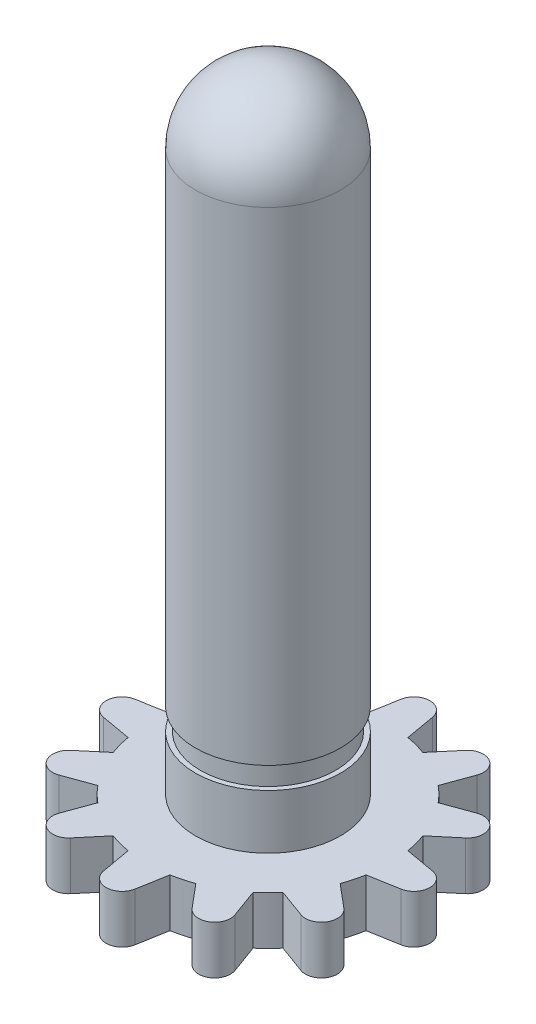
ISO-10303-21;
HEADER;
FILE_DESCRIPTION(('STEP AP214'),'2;1');
FILE_NAME('part.step','',(''),(''),'','','');
FILE_SCHEMA(('AUTOMOTIVE_DESIGN { 1 0 10303 214 1 1 1 1 }'));
ENDSEC;
DATA;
#1=APPLICATION_CONTEXT('core data for automotive mechanical design processes');
#2=APPLICATION_PROTOCOL_DEFINITION('international standard','automotive_design',2000,#1);
#3=PRODUCT_CONTEXT('',#1,'mechanical');
#4=PRODUCT('Part','Part','',(#3));
#5=PRODUCT_RELATED_PRODUCT_CATEGORY('part','',(#4));
#6=PRODUCT_DEFINITION_FORMATION('','',#4);
#7=PRODUCT_DEFINITION_CONTEXT('part definition',#1,'design');
#8=PRODUCT_DEFINITION('design','',#6,#7);
#9=PRODUCT_DEFINITION_SHAPE('','',#8);
#10=(LENGTH_UNIT() NAMED_UNIT(*) SI_UNIT(.MILLI.,.METRE.));
#11=(NAMED_UNIT(*) PLANE_ANGLE_UNIT() SI_UNIT($,.RADIAN.));
#12=(NAMED_UNIT(*) SI_UNIT($,.STERADIAN.) SOLID_ANGLE_UNIT());
#13=UNCERTAINTY_MEASURE_WITH_UNIT(LENGTH_MEASURE(1.E-05),#10,'distance_accuracy_value','');
#14=(GEOMETRIC_REPRESENTATION_CONTEXT(3) GLOBAL_UNCERTAINTY_ASSIGNED_CONTEXT((#13)) GLOBAL_UNIT_ASSIGNED_CONTEXT((#10,
#11,#12)) REPRESENTATION_CONTEXT('',''));
#15=CARTESIAN_POINT('',(0.,0.,0.));
#16=DIRECTION('',(0.,0.,1.));
#17=DIRECTION('',(1.,0.,0.));
#18=AXIS2_PLACEMENT_3D('',#15,#16,#17);
#19=CARTESIAN_POINT('',(0.,4.25,0.));
#20=DIRECTION('',(0.,1.,0.));
#21=DIRECTION('',(0.,0.,1.));
#22=AXIS2_PLACEMENT_3D('',#19,#20,#21);
#23=PLANE('',#22);
#24=CARTESIAN_POINT('',(0.,4.25,0.));
#25=DIRECTION('',(0.,1.,0.));
#26=DIRECTION('',(0.,0.,1.));
#27=AXIS2_PLACEMENT_3D('',#24,#25,#26);
#28=CIRCLE('',#27,3.);
#29=CARTESIAN_POINT('',(0.,4.25,3.));
#30=VERTEX_POINT('',#29);
#31=EDGE_CURVE('E726',#30,#30,#28,.T.);
#32=ORIENTED_EDGE('',*,*,#31,.T.);
#33=EDGE_LOOP('',(#32));
#34=FACE_BOUND('',#33,.T.);
#35=CARTESIAN_POINT('',(0.,4.25,0.));
#36=DIRECTION('',(0.,1.,0.));
#37=DIRECTION('',(0.,0.,1.));
#38=AXIS2_PLACEMENT_3D('',#35,#36,#37);
#39=CIRCLE('',#38,2.8);
#40=CARTESIAN_POINT('',(0.,4.25,2.8));
#41=VERTEX_POINT('',#40);
#42=EDGE_CURVE('E1346',#41,#41,#39,.T.);
#43=ORIENTED_EDGE('',*,*,#42,.F.);
#44=EDGE_LOOP('',(#43));
#45=FACE_BOUND('',#44,.T.);
#46=ADVANCED_FACE('F38',(#34,#45),#23,.T.);
#47=CARTESIAN_POINT('',(0.,2.,0.));
#48=DIRECTION('',(0.,1.,0.));
#49=DIRECTION('',(0.,0.,1.));
#50=AXIS2_PLACEMENT_3D('',#47,#48,#49);
#51=PLANE('',#50);
#52=CARTESIAN_POINT('',(0.,2.,0.));
#53=DIRECTION('',(0.,1.,0.));
#54=DIRECTION('',(0.,0.,1.));
#55=AXIS2_PLACEMENT_3D('',#52,#53,#54);
#56=CIRCLE('',#55,5.);
#57=CARTESIAN_POINT('',(-0.866938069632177,2.,-4.92426830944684));
#58=VERTEX_POINT('',#57);
#59=CARTESIAN_POINT('',(-1.71134376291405,2.,-4.69801048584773));
#60=VERTEX_POINT('',#59);
#61=EDGE_CURVE('E374',#58,#60,#56,.T.);
#62=ORIENTED_EDGE('',*,*,#61,.T.);
#63=DIRECTION('',(-0.642787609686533,0.,-0.766044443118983));
#64=VECTOR('',#63,1.);
#65=CARTESIAN_POINT('',(-1.71134376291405,2.,-4.69801048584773));
#66=LINE('',#65,#64);
#67=CARTESIAN_POINT('',(-2.51437610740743,2.,-5.65502716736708));
#68=VERTEX_POINT('',#67);
#69=EDGE_CURVE('E698',#60,#68,#66,.T.);
#70=ORIENTED_EDGE('',*,*,#69,.T.);
#71=CARTESIAN_POINT('',(-3.01998635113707,2.,-5.2307697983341));
#72=DIRECTION('',(0.,1.,0.));
#73=DIRECTION('',(0.499999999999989,0.,0.866025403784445));
#74=AXIS2_PLACEMENT_3D('',#71,#72,#73);
#75=CIRCLE('',#74,0.660027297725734);
#76=CARTESIAN_POINT('',(-3.64020913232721,2.,-5.0050271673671));
#77=VERTEX_POINT('',#76);
#78=EDGE_CURVE('E11',#68,#77,#75,.T.);
#79=ORIENTED_EDGE('',*,*,#78,.T.);
#80=DIRECTION('',(0.342020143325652,0.,0.939692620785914));
#81=VECTOR('',#80,1.);
#82=CARTESIAN_POINT('',(-3.21292454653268,2.,-3.83107241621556));
#83=LINE('',#82,#81);
#84=CARTESIAN_POINT('',(-3.21292454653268,2.,-3.83107241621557));
#85=VERTEX_POINT('',#84);
#86=EDGE_CURVE('E61',#77,#85,#83,.T.);
#87=ORIENTED_EDGE('',*,*,#86,.T.);
#88=CARTESIAN_POINT('',(-3.83107241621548,2.,-3.21292454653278));
#89=VERTEX_POINT('',#88);
#90=EDGE_CURVE('E383',#85,#89,#56,.T.);
#91=ORIENTED_EDGE('',*,*,#90,.T.);
#92=DIRECTION('',(-0.939692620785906,0.,-0.342020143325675));
#93=VECTOR('',#92,1.);
#94=CARTESIAN_POINT('',(-3.83107241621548,2.,-3.21292454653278));
#95=LINE('',#94,#93);
#96=CARTESIAN_POINT('',(-5.00502716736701,2.,-3.64020913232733));
#97=VERTEX_POINT('',#96);
#98=EDGE_CURVE('E669',#89,#97,#95,.T.);
#99=ORIENTED_EDGE('',*,*,#98,.T.);
#100=CARTESIAN_POINT('',(-5.23076979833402,2.,-3.01998635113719));
#101=DIRECTION('',(0.,1.,0.));
#102=DIRECTION('',(0.866025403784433,0.,0.50000000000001));
#103=AXIS2_PLACEMENT_3D('',#100,#101,#102);
#104=CIRCLE('',#103,0.660027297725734);
#105=CARTESIAN_POINT('',(-5.65502716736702,2.,-2.51437610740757));
#106=VERTEX_POINT('',#105);
#107=EDGE_CURVE('E690',#97,#106,#104,.T.);
#108=ORIENTED_EDGE('',*,*,#107,.T.);
#109=DIRECTION('',(0.766044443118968,0.,0.642787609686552));
#110=VECTOR('',#109,1.);
#111=CARTESIAN_POINT('',(-4.69801048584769,2.,-1.71134376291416));
#112=LINE('',#111,#110);
#113=CARTESIAN_POINT('',(-4.69801048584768,2.,-1.71134376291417));
#114=VERTEX_POINT('',#113);
#115=EDGE_CURVE('E681',#106,#114,#112,.T.);
#116=ORIENTED_EDGE('',*,*,#115,.T.);
#117=CARTESIAN_POINT('',(-4.92426830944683,2.,-0.866938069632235));
#118=VERTEX_POINT('',#117);
#119=EDGE_CURVE('E662',#114,#118,#56,.T.);
#120=ORIENTED_EDGE('',*,*,#119,.T.);
#121=DIRECTION('',(-0.984807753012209,0.,0.173648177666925));
#122=VECTOR('',#121,1.);
#123=CARTESIAN_POINT('',(-4.92426830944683,2.,-0.866938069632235));
#124=LINE('',#123,#122);
#125=CARTESIAN_POINT('',(-6.15458523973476,2.,-0.650000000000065));
#126=VERTEX_POINT('',#125);
#127=EDGE_CURVE('E638',#118,#126,#124,.T.);
#128=ORIENTED_EDGE('',*,*,#127,.T.);
#129=CARTESIAN_POINT('',(-6.03997270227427,2.,0.));
#130=DIRECTION('',(0.,1.,0.));
#131=DIRECTION('',(1.,0.,0.));
#132=AXIS2_PLACEMENT_3D('',#129,#130,#131);
#133=CIRCLE('',#132,0.660027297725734);
#134=CARTESIAN_POINT('',(-6.15458523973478,2.,0.649999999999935));
#135=VERTEX_POINT('',#134);
#136=EDGE_CURVE('E659',#126,#135,#133,.T.);
#137=ORIENTED_EDGE('',*,*,#136,.T.);
#138=DIRECTION('',(0.984807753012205,0.,0.173648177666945));
#139=VECTOR('',#138,1.);
#140=CARTESIAN_POINT('',(-4.92426830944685,2.,0.866938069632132));
#141=LINE('',#140,#139);
#142=CARTESIAN_POINT('',(-4.92426830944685,2.,0.866938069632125));
#143=VERTEX_POINT('',#142);
#144=EDGE_CURVE('E650',#135,#143,#141,.T.);
#145=ORIENTED_EDGE('',*,*,#144,.T.);
#146=CARTESIAN_POINT('',(-4.69801048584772,2.,1.71134376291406));
#147=VERTEX_POINT('',#146);
#148=EDGE_CURVE('E631',#143,#147,#56,.T.);
#149=ORIENTED_EDGE('',*,*,#148,.T.);
#150=DIRECTION('',(-0.766044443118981,0.,0.642787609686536));
#151=VECTOR('',#150,1.);
#152=CARTESIAN_POINT('',(-4.69801048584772,2.,1.71134376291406));
#153=LINE('',#152,#151);
#154=CARTESIAN_POINT('',(-5.65502716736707,2.,2.51437610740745));
#155=VERTEX_POINT('',#154);
#156=EDGE_CURVE('E607',#147,#155,#153,.T.);
#157=ORIENTED_EDGE('',*,*,#156,.T.);
#158=CARTESIAN_POINT('',(-5.23076979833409,2.,3.01998635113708));
#159=DIRECTION('',(0.,1.,0.));
#160=DIRECTION('',(0.866025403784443,0.,-0.499999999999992));
#161=AXIS2_PLACEMENT_3D('',#158,#159,#160);
#162=CIRCLE('',#161,0.660027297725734);
#163=CARTESIAN_POINT('',(-5.00502716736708,2.,3.64020913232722));
#164=VERTEX_POINT('',#163);
#165=EDGE_CURVE('E628',#155,#164,#162,.T.);
#166=ORIENTED_EDGE('',*,*,#165,.T.);
#167=DIRECTION('',(0.939692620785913,0.,-0.342020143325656));
#168=VECTOR('',#167,1.);
#169=CARTESIAN_POINT('',(-3.83107241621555,2.,3.2129245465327));
#170=LINE('',#169,#168);
#171=CARTESIAN_POINT('',(-3.83107241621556,2.,3.21292454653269));
#172=VERTEX_POINT('',#171);
#173=EDGE_CURVE('E619',#164,#172,#170,.T.);
#174=ORIENTED_EDGE('',*,*,#173,.T.);
#175=CARTESIAN_POINT('',(-3.21292454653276,2.,3.8310724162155));
#176=VERTEX_POINT('',#175);
#177=EDGE_CURVE('E600',#172,#176,#56,.T.);
#178=ORIENTED_EDGE('',*,*,#177,.T.);
#179=DIRECTION('',(-0.342020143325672,0.,0.939692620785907));
#180=VECTOR('',#179,1.);
#181=CARTESIAN_POINT('',(-3.21292454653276,2.,3.8310724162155));
#182=LINE('',#181,#180);
#183=CARTESIAN_POINT('',(-3.64020913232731,2.,5.00502716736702));
#184=VERTEX_POINT('',#183);
#185=EDGE_CURVE('E576',#176,#184,#182,.T.);
#186=ORIENTED_EDGE('',*,*,#185,.T.);
#187=CARTESIAN_POINT('',(-3.01998635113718,2.,5.23076979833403));
#188=DIRECTION('',(0.,1.,0.));
#189=DIRECTION('',(0.500000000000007,0.,-0.866025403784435));
#190=AXIS2_PLACEMENT_3D('',#187,#188,#189);
#191=CIRCLE('',#190,0.660027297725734);
#192=CARTESIAN_POINT('',(-2.51437610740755,2.,5.65502716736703));
#193=VERTEX_POINT('',#192);
#194=EDGE_CURVE('E597',#184,#193,#191,.T.);
#195=ORIENTED_EDGE('',*,*,#194,.T.);
#196=DIRECTION('',(0.642787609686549,0.,-0.76604444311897));
#197=VECTOR('',#196,1.);
#198=CARTESIAN_POINT('',(-1.71134376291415,2.,4.69801048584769));
#199=LINE('',#198,#197);
#200=CARTESIAN_POINT('',(-1.71134376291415,2.,4.69801048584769));
#201=VERTEX_POINT('',#200);
#202=EDGE_CURVE('E588',#193,#201,#199,.T.);
#203=ORIENTED_EDGE('',*,*,#202,.T.);
#204=CARTESIAN_POINT('',(-0.866938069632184,2.,4.92426830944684));
#205=VERTEX_POINT('',#204);
#206=EDGE_CURVE('E569',#201,#205,#56,.T.);
#207=ORIENTED_EDGE('',*,*,#206,.T.);
#208=DIRECTION('',(0.173648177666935,0.,0.984807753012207));
#209=VECTOR('',#208,1.);
#210=CARTESIAN_POINT('',(-0.866938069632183,2.,4.92426830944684));
#211=LINE('',#210,#209);
#212=CARTESIAN_POINT('',(-0.65,2.,6.15458523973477));
#213=VERTEX_POINT('',#212);
#214=EDGE_CURVE('E545',#205,#213,#211,.T.);
#215=ORIENTED_EDGE('',*,*,#214,.T.);
#216=CARTESIAN_POINT('',(0.,2.,6.03997270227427));
#217=DIRECTION('',(0.,1.,0.));
#218=DIRECTION('',(0.,0.,-1.));
#219=AXIS2_PLACEMENT_3D('',#216,#217,#218);
#220=CIRCLE('',#219,0.660027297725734);
#221=CARTESIAN_POINT('',(0.65,2.,6.15458523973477));
#222=VERTEX_POINT('',#221);
#223=EDGE_CURVE('E566',#213,#222,#220,.T.);
#224=ORIENTED_EDGE('',*,*,#223,.T.);
#225=DIRECTION('',(0.173648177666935,0.,-0.984807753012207));
#226=VECTOR('',#225,1.);
#227=CARTESIAN_POINT('',(0.866938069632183,2.,4.92426830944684));
#228=LINE('',#227,#226);
#229=CARTESIAN_POINT('',(0.866938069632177,2.,4.92426830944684));
#230=VERTEX_POINT('',#229);
#231=EDGE_CURVE('E557',#222,#230,#228,.T.);
#232=ORIENTED_EDGE('',*,*,#231,.T.);
#233=CARTESIAN_POINT('',(1.71134376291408,2.,4.69801048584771));
#234=VERTEX_POINT('',#233);
#235=EDGE_CURVE('E538',#230,#234,#56,.T.);
#236=ORIENTED_EDGE('',*,*,#235,.T.);
#237=DIRECTION('',(0.642787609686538,0.,0.766044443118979));
#238=VECTOR('',#237,1.);
#239=CARTESIAN_POINT('',(1.71134376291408,2.,4.69801048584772));
#240=LINE('',#239,#238);
#241=CARTESIAN_POINT('',(2.51437610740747,2.,5.65502716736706));
#242=VERTEX_POINT('',#241);
#243=EDGE_CURVE('E514',#234,#242,#240,.T.);
#244=ORIENTED_EDGE('',*,*,#243,.T.);
#245=CARTESIAN_POINT('',(3.0199863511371,2.,5.23076979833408));
#246=DIRECTION('',(0.,1.,0.));
#247=DIRECTION('',(-0.499999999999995,0.,-0.866025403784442));
#248=AXIS2_PLACEMENT_3D('',#245,#246,#247);
#249=CIRCLE('',#248,0.660027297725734);
#250=CARTESIAN_POINT('',(3.64020913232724,2.,5.00502716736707));
#251=VERTEX_POINT('',#250);
#252=EDGE_CURVE('E535',#242,#251,#249,.T.);
#253=ORIENTED_EDGE('',*,*,#252,.T.);
#254=DIRECTION('',(-0.342020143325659,0.,-0.939692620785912));
#255=VECTOR('',#254,1.);
#256=CARTESIAN_POINT('',(3.21292454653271,2.,3.83107241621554));
#257=LINE('',#256,#255);
#258=CARTESIAN_POINT('',(3.21292454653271,2.,3.83107241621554));
#259=VERTEX_POINT('',#258);
#260=EDGE_CURVE('E526',#251,#259,#257,.T.);
#261=ORIENTED_EDGE('',*,*,#260,.T.);
#262=CARTESIAN_POINT('',(3.83107241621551,2.,3.21292454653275));
#263=VERTEX_POINT('',#262);
#264=EDGE_CURVE('E507',#259,#263,#56,.T.);
#265=ORIENTED_EDGE('',*,*,#264,.T.);
#266=DIRECTION('',(0.939692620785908,0.,0.342020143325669));
#267=VECTOR('',#266,1.);
#268=CARTESIAN_POINT('',(3.83107241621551,2.,3.21292454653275));
#269=LINE('',#268,#267);
#270=CARTESIAN_POINT('',(5.00502716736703,2.,3.64020913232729));
#271=VERTEX_POINT('',#270);
#272=EDGE_CURVE('E483',#263,#271,#269,.T.);
#273=ORIENTED_EDGE('',*,*,#272,.T.);
#274=CARTESIAN_POINT('',(5.23076979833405,2.,3.01998635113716));
#275=DIRECTION('',(0.,1.,0.));
#276=DIRECTION('',(-0.866025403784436,0.,-0.500000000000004));
#277=AXIS2_PLACEMENT_3D('',#274,#275,#276);
#278=CIRCLE('',#277,0.660027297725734);
#279=CARTESIAN_POINT('',(5.65502716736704,2.,2.51437610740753));
#280=VERTEX_POINT('',#279);
#281=EDGE_CURVE('E504',#271,#280,#278,.T.);
#282=ORIENTED_EDGE('',*,*,#281,.T.);
#283=DIRECTION('',(-0.766044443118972,0.,-0.642787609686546));
#284=VECTOR('',#283,1.);
#285=CARTESIAN_POINT('',(4.6980104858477,2.,1.71134376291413));
#286=LINE('',#285,#284);
#287=CARTESIAN_POINT('',(4.6980104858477,2.,1.71134376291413));
#288=VERTEX_POINT('',#287);
#289=EDGE_CURVE('E495',#280,#288,#286,.T.);
#290=ORIENTED_EDGE('',*,*,#289,.T.);
#291=CARTESIAN_POINT('',(4.92426830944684,2.,0.866938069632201));
#292=VERTEX_POINT('',#291);
#293=EDGE_CURVE('E476',#288,#292,#56,.T.);
#294=ORIENTED_EDGE('',*,*,#293,.T.);
#295=DIRECTION('',(0.984807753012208,0.,-0.173648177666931));
#296=VECTOR('',#295,1.);
#297=CARTESIAN_POINT('',(4.92426830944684,2.,0.866938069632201));
#298=LINE('',#297,#296);
#299=CARTESIAN_POINT('',(6.15458523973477,2.,0.650000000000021));
#300=VERTEX_POINT('',#299);
#301=EDGE_CURVE('E452',#292,#300,#298,.T.);
#302=ORIENTED_EDGE('',*,*,#301,.T.);
#303=CARTESIAN_POINT('',(6.03997270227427,2.,0.));
#304=DIRECTION('',(0.,1.,0.));
#305=DIRECTION('',(-1.,0.,0.));
#306=AXIS2_PLACEMENT_3D('',#303,#304,#305);
#307=CIRCLE('',#306,0.660027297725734);
#308=CARTESIAN_POINT('',(6.15458523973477,2.,-0.649999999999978));
#309=VERTEX_POINT('',#308);
#310=EDGE_CURVE('E473',#300,#309,#307,.T.);
#311=ORIENTED_EDGE('',*,*,#310,.T.);
#312=DIRECTION('',(-0.984807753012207,0.,-0.173648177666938));
#313=VECTOR('',#312,1.);
#314=CARTESIAN_POINT('',(4.92426830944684,2.,-0.866938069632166));
#315=LINE('',#314,#313);
#316=CARTESIAN_POINT('',(4.92426830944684,2.,-0.86693806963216));
#317=VERTEX_POINT('',#316);
#318=EDGE_CURVE('E464',#309,#317,#315,.T.);
#319=ORIENTED_EDGE('',*,*,#318,.T.);
#320=CARTESIAN_POINT('',(4.69801048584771,2.,-1.71134376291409));
#321=VERTEX_POINT('',#320);
#322=EDGE_CURVE('E445',#317,#321,#56,.T.);
#323=ORIENTED_EDGE('',*,*,#322,.T.);
#324=DIRECTION('',(0.766044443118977,0.,-0.642787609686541));
#325=VECTOR('',#324,1.);
#326=CARTESIAN_POINT('',(4.69801048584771,2.,-1.7113437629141));
#327=LINE('',#326,#325);
#328=CARTESIAN_POINT('',(5.65502716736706,2.,-2.51437610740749));
#329=VERTEX_POINT('',#328);
#330=EDGE_CURVE('E421',#321,#329,#327,.T.);
#331=ORIENTED_EDGE('',*,*,#330,.T.);
#332=CARTESIAN_POINT('',(5.23076979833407,2.,-3.01998635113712));
#333=DIRECTION('',(0.,1.,0.));
#334=DIRECTION('',(-0.86602540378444,0.,0.499999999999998));
#335=AXIS2_PLACEMENT_3D('',#332,#333,#334);
#336=CIRCLE('',#335,0.660027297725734);
#337=CARTESIAN_POINT('',(5.00502716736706,2.,-3.64020913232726));
#338=VERTEX_POINT('',#337);
#339=EDGE_CURVE('E442',#329,#338,#336,.T.);
#340=ORIENTED_EDGE('',*,*,#339,.T.);
#341=DIRECTION('',(-0.939692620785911,0.,0.342020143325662));
#342=VECTOR('',#341,1.);
#343=CARTESIAN_POINT('',(3.83107241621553,2.,-3.21292454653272));
#344=LINE('',#343,#342);
#345=CARTESIAN_POINT('',(3.83107241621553,2.,-3.21292454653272));
#346=VERTEX_POINT('',#345);
#347=EDGE_CURVE('E433',#338,#346,#344,.T.);
#348=ORIENTED_EDGE('',*,*,#347,.T.);
#349=CARTESIAN_POINT('',(3.21292454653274,2.,-3.83107241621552));
#350=VERTEX_POINT('',#349);
#351=EDGE_CURVE('E414',#346,#350,#56,.T.);
#352=ORIENTED_EDGE('',*,*,#351,.T.);
#353=DIRECTION('',(0.342020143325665,0.,-0.939692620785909));
#354=VECTOR('',#353,1.);
#355=CARTESIAN_POINT('',(3.21292454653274,2.,-3.83107241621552));
#356=LINE('',#355,#354);
#357=CARTESIAN_POINT('',(3.64020913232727,2.,-5.00502716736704));
#358=VERTEX_POINT('',#357);
#359=EDGE_CURVE('E390',#350,#358,#356,.T.);
#360=ORIENTED_EDGE('',*,*,#359,.T.);
#361=CARTESIAN_POINT('',(3.01998635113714,2.,-5.23076979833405));
#362=DIRECTION('',(0.,1.,0.));
#363=DIRECTION('',(-0.500000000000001,0.,0.866025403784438));
#364=AXIS2_PLACEMENT_3D('',#361,#362,#363);
#365=CIRCLE('',#364,0.660027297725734);
#366=CARTESIAN_POINT('',(2.51437610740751,2.,-5.65502716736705));
#367=VERTEX_POINT('',#366);
#368=EDGE_CURVE('E411',#358,#367,#365,.T.);
#369=ORIENTED_EDGE('',*,*,#368,.T.);
#370=DIRECTION('',(-0.642787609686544,0.,0.766044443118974));
#371=VECTOR('',#370,1.);
#372=CARTESIAN_POINT('',(1.71134376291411,2.,-4.6980104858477));
#373=LINE('',#372,#371);
#374=CARTESIAN_POINT('',(1.71134376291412,2.,-4.6980104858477));
#375=VERTEX_POINT('',#374);
#376=EDGE_CURVE('E402',#367,#375,#373,.T.);
#377=ORIENTED_EDGE('',*,*,#376,.T.);
#378=CARTESIAN_POINT('',(0.866938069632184,2.,-4.92426830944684));
#379=VERTEX_POINT('',#378);
#380=EDGE_CURVE('E382',#375,#379,#56,.T.);
#381=ORIENTED_EDGE('',*,*,#380,.T.);
#382=DIRECTION('',(-0.173648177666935,0.,-0.984807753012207));
#383=VECTOR('',#382,1.);
#384=CARTESIAN_POINT('',(0.866938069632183,2.,-4.92426830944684));
#385=LINE('',#384,#383);
#386=CARTESIAN_POINT('',(0.65,2.,-6.15458523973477));
#387=VERTEX_POINT('',#386);
#388=EDGE_CURVE('E357',#379,#387,#385,.T.);
#389=ORIENTED_EDGE('',*,*,#388,.T.);
#390=CARTESIAN_POINT('',(0.,2.,-6.03997270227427));
#391=DIRECTION('',(0.,1.,0.));
#392=DIRECTION('',(0.,0.,1.));
#393=AXIS2_PLACEMENT_3D('',#390,#391,#392);
#394=CIRCLE('',#393,0.660027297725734);
#395=CARTESIAN_POINT('',(-0.65,2.,-6.15458523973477));
#396=VERTEX_POINT('',#395);
#397=EDGE_CURVE('E358',#387,#396,#394,.T.);
#398=ORIENTED_EDGE('',*,*,#397,.T.);
#399=DIRECTION('',(-0.173648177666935,0.,0.984807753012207));
#400=VECTOR('',#399,1.);
#401=CARTESIAN_POINT('',(-0.866938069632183,2.,-4.92426830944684));
#402=LINE('',#401,#400);
#403=EDGE_CURVE('E347',#396,#58,#402,.T.);
#404=ORIENTED_EDGE('',*,*,#403,.T.);
#405=EDGE_LOOP('',(#62,#70,#79,#87,#91,#99,#108,#116,#120,#128,#137,#145,#149,#157,#166,#174,
#178,#186,#195,#203,#207,#215,#224,#232,#236,#244,#253,#261,#265,#273,#282,#290,#294,#302,#311,
#319,#323,#331,#340,#348,#352,#360,#369,#377,#381,#389,#398,#404));
#406=FACE_BOUND('',#405,.T.);
#407=CARTESIAN_POINT('',(0.,2.,0.));
#408=DIRECTION('',(0.,1.,0.));
#409=DIRECTION('',(0.,0.,1.));
#410=AXIS2_PLACEMENT_3D('',#407,#408,#409);
#411=CIRCLE('',#410,3.);
#412=CARTESIAN_POINT('',(0.,2.,3.));
#413=VERTEX_POINT('',#412);
#414=EDGE_CURVE('E1357',#413,#413,#411,.T.);
#415=ORIENTED_EDGE('',*,*,#414,.F.);
#416=EDGE_LOOP('',(#415));
#417=FACE_BOUND('',#416,.T.);
#418=ADVANCED_FACE('F361',(#406,#417),#51,.T.);
#419=CARTESIAN_POINT('',(0.,2.,0.));
#420=DIRECTION('',(0.,-1.,0.));
#421=DIRECTION('',(0.,0.,-1.));
#422=AXIS2_PLACEMENT_3D('',#419,#420,#421);
#423=CYLINDRICAL_SURFACE('',#422,5.);
#424=ORIENTED_EDGE('',*,*,#90,.F.);
#425=DIRECTION('',(0.,-1.,0.));
#426=VECTOR('',#425,1.);
#427=CARTESIAN_POINT('',(-3.21292454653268,2.,-3.83107241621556));
#428=LINE('',#427,#426);
#429=CARTESIAN_POINT('',(-3.21292454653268,0.,-3.83107241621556));
#430=VERTEX_POINT('',#429);
#431=EDGE_CURVE('E705',#85,#430,#428,.T.);
#432=ORIENTED_EDGE('',*,*,#431,.T.);
#433=CARTESIAN_POINT('',(0.,0.,0.));
#434=DIRECTION('',(0.,1.,0.));
#435=DIRECTION('',(0.,0.,1.));
#436=AXIS2_PLACEMENT_3D('',#433,#434,#435);
#437=CIRCLE('',#436,5.);
#438=CARTESIAN_POINT('',(-3.83107241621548,0.,-3.21292454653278));
#439=VERTEX_POINT('',#438);
#440=EDGE_CURVE('E376',#430,#439,#437,.T.);
#441=ORIENTED_EDGE('',*,*,#440,.T.);
#442=DIRECTION('',(0.,-1.,0.));
#443=VECTOR('',#442,1.);
#444=CARTESIAN_POINT('',(-3.83107241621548,2.,-3.21292454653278));
#445=LINE('',#444,#443);
#446=EDGE_CURVE('E672',#89,#439,#445,.T.);
#447=ORIENTED_EDGE('',*,*,#446,.F.);
#448=EDGE_LOOP('',(#424,#432,#441,#447));
#449=FACE_BOUND('',#448,.T.);
#450=ADVANCED_FACE('F756',(#449),#423,.T.);
#451=CARTESIAN_POINT('',(-3.01998635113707,2.,-5.2307697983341));
#452=DIRECTION('',(0.,-1.,0.));
#453=DIRECTION('',(-0.499999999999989,0.,-0.866025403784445));
#454=AXIS2_PLACEMENT_3D('',#451,#452,#453);
#455=CYLINDRICAL_SURFACE('',#454,0.660027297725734);
#456=CARTESIAN_POINT('',(-3.01998635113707,0.,-5.2307697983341));
#457=DIRECTION('',(0.,1.,0.));
#458=DIRECTION('',(0.499999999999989,0.,0.866025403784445));
#459=AXIS2_PLACEMENT_3D('',#456,#457,#458);
#460=CIRCLE('',#459,0.660027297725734);
#461=CARTESIAN_POINT('',(-2.51437610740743,0.,-5.65502716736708));
#462=VERTEX_POINT('',#461);
#463=CARTESIAN_POINT('',(-3.64020913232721,0.,-5.0050271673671));
#464=VERTEX_POINT('',#463);
#465=EDGE_CURVE('E47',#462,#464,#460,.T.);
#466=ORIENTED_EDGE('',*,*,#465,.T.);
#467=DIRECTION('',(0.,-1.,0.));
#468=VECTOR('',#467,1.);
#469=CARTESIAN_POINT('',(-3.64020913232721,2.,-5.0050271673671));
#470=LINE('',#469,#468);
#471=EDGE_CURVE('E709',#77,#464,#470,.T.);
#472=ORIENTED_EDGE('',*,*,#471,.F.);
#473=ORIENTED_EDGE('',*,*,#78,.F.);
#474=DIRECTION('',(0.,-1.,0.));
#475=VECTOR('',#474,1.);
#476=CARTESIAN_POINT('',(-2.51437610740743,2.,-5.65502716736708));
#477=LINE('',#476,#475);
#478=EDGE_CURVE('E695',#68,#462,#477,.T.);
#479=ORIENTED_EDGE('',*,*,#478,.T.);
#480=EDGE_LOOP('',(#466,#472,#473,#479));
#481=FACE_BOUND('',#480,.T.);
#482=ADVANCED_FACE('F713',(#481),#455,.T.);
#483=CARTESIAN_POINT('',(-3.21292454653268,2.,-3.83107241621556));
#484=DIRECTION('',(0.939692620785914,0.,-0.342020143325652));
#485=DIRECTION('',(-0.342020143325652,0.,-0.939692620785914));
#486=AXIS2_PLACEMENT_3D('',#483,#484,#485);
#487=PLANE('',#486);
#488=DIRECTION('',(0.342020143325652,0.,0.939692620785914));
#489=VECTOR('',#488,1.);
#490=CARTESIAN_POINT('',(-3.21292454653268,0.,-3.83107241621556));
#491=LINE('',#490,#489);
#492=EDGE_CURVE('E54',#464,#430,#491,.T.);
#493=ORIENTED_EDGE('',*,*,#492,.T.);
#494=ORIENTED_EDGE('',*,*,#431,.F.);
#495=ORIENTED_EDGE('',*,*,#86,.F.);
#496=ORIENTED_EDGE('',*,*,#471,.T.);
#497=EDGE_LOOP('',(#493,#494,#495,#496));
#498=FACE_BOUND('',#497,.T.);
#499=ADVANCED_FACE('F1014',(#498),#487,.F.);
#500=CARTESIAN_POINT('',(-1.71134376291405,2.,-4.69801048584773));
#501=DIRECTION('',(-0.766044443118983,0.,0.642787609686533));
#502=DIRECTION('',(0.642787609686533,0.,0.766044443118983));
#503=AXIS2_PLACEMENT_3D('',#500,#501,#502);
#504=PLANE('',#503);
#505=DIRECTION('',(-0.642787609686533,0.,-0.766044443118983));
#506=VECTOR('',#505,1.);
#507=CARTESIAN_POINT('',(-1.71134376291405,0.,-4.69801048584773));
#508=LINE('',#507,#506);
#509=CARTESIAN_POINT('',(-1.71134376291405,0.,-4.69801048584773));
#510=VERTEX_POINT('',#509);
#511=EDGE_CURVE('E693',#510,#462,#508,.T.);
#512=ORIENTED_EDGE('',*,*,#511,.T.);
#513=ORIENTED_EDGE('',*,*,#478,.F.);
#514=ORIENTED_EDGE('',*,*,#69,.F.);
#515=DIRECTION('',(0.,-1.,0.));
#516=VECTOR('',#515,1.);
#517=CARTESIAN_POINT('',(-1.71134376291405,2.,-4.69801048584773));
#518=LINE('',#517,#516);
#519=EDGE_CURVE('E701',#60,#510,#518,.T.);
#520=ORIENTED_EDGE('',*,*,#519,.T.);
#521=EDGE_LOOP('',(#512,#513,#514,#520));
#522=FACE_BOUND('',#521,.T.);
#523=ADVANCED_FACE('F720',(#522),#504,.F.);
#524=ORIENTED_EDGE('',*,*,#119,.F.);
#525=DIRECTION('',(0.,-1.,0.));
#526=VECTOR('',#525,1.);
#527=CARTESIAN_POINT('',(-4.69801048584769,2.,-1.71134376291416));
#528=LINE('',#527,#526);
#529=CARTESIAN_POINT('',(-4.69801048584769,0.,-1.71134376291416));
#530=VERTEX_POINT('',#529);
#531=EDGE_CURVE('E678',#114,#530,#528,.T.);
#532=ORIENTED_EDGE('',*,*,#531,.T.);
#533=CARTESIAN_POINT('',(-4.92426830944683,0.,-0.866938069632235));
#534=VERTEX_POINT('',#533);
#535=EDGE_CURVE('E666',#530,#534,#437,.T.);
#536=ORIENTED_EDGE('',*,*,#535,.T.);
#537=DIRECTION('',(0.,-1.,0.));
#538=VECTOR('',#537,1.);
#539=CARTESIAN_POINT('',(-4.92426830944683,2.,-0.866938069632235));
#540=LINE('',#539,#538);
#541=EDGE_CURVE('E641',#118,#534,#540,.T.);
#542=ORIENTED_EDGE('',*,*,#541,.F.);
#543=EDGE_LOOP('',(#524,#532,#536,#542));
#544=FACE_BOUND('',#543,.T.);
#545=ADVANCED_FACE('F768',(#544),#423,.T.);
#546=CARTESIAN_POINT('',(-5.23076979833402,2.,-3.01998635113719));
#547=DIRECTION('',(0.,-1.,0.));
#548=DIRECTION('',(-0.866025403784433,0.,-0.50000000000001));
#549=AXIS2_PLACEMENT_3D('',#546,#547,#548);
#550=CYLINDRICAL_SURFACE('',#549,0.660027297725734);
#551=CARTESIAN_POINT('',(-5.23076979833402,0.,-3.01998635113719));
#552=DIRECTION('',(0.,1.,0.));
#553=DIRECTION('',(0.866025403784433,0.,0.50000000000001));
#554=AXIS2_PLACEMENT_3D('',#551,#552,#553);
#555=CIRCLE('',#554,0.660027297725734);
#556=CARTESIAN_POINT('',(-5.00502716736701,0.,-3.64020913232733));
#557=VERTEX_POINT('',#556);
#558=CARTESIAN_POINT('',(-5.65502716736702,0.,-2.51437610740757));
#559=VERTEX_POINT('',#558);
#560=EDGE_CURVE('E687',#557,#559,#555,.T.);
#561=ORIENTED_EDGE('',*,*,#560,.T.);
#562=DIRECTION('',(0.,-1.,0.));
#563=VECTOR('',#562,1.);
#564=CARTESIAN_POINT('',(-5.65502716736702,2.,-2.51437610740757));
#565=LINE('',#564,#563);
#566=EDGE_CURVE('E684',#106,#559,#565,.T.);
#567=ORIENTED_EDGE('',*,*,#566,.F.);
#568=ORIENTED_EDGE('',*,*,#107,.F.);
#569=DIRECTION('',(0.,-1.,0.));
#570=VECTOR('',#569,1.);
#571=CARTESIAN_POINT('',(-5.00502716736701,2.,-3.64020913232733));
#572=LINE('',#571,#570);
#573=EDGE_CURVE('E665',#97,#557,#572,.T.);
#574=ORIENTED_EDGE('',*,*,#573,.T.);
#575=EDGE_LOOP('',(#561,#567,#568,#574));
#576=FACE_BOUND('',#575,.T.);
#577=ADVANCED_FACE('F763',(#576),#550,.T.);
#578=CARTESIAN_POINT('',(-4.69801048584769,2.,-1.71134376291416));
#579=DIRECTION('',(0.642787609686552,0.,-0.766044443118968));
#580=DIRECTION('',(-0.766044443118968,0.,-0.642787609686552));
#581=AXIS2_PLACEMENT_3D('',#578,#579,#580);
#582=PLANE('',#581);
#583=DIRECTION('',(0.766044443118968,0.,0.642787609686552));
#584=VECTOR('',#583,1.);
#585=CARTESIAN_POINT('',(-4.69801048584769,0.,-1.71134376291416));
#586=LINE('',#585,#584);
#587=EDGE_CURVE('E675',#559,#530,#586,.T.);
#588=ORIENTED_EDGE('',*,*,#587,.T.);
#589=ORIENTED_EDGE('',*,*,#531,.F.);
#590=ORIENTED_EDGE('',*,*,#115,.F.);
#591=ORIENTED_EDGE('',*,*,#566,.T.);
#592=EDGE_LOOP('',(#588,#589,#590,#591));
#593=FACE_BOUND('',#592,.T.);
#594=ADVANCED_FACE('F765',(#593),#582,.F.);
#595=CARTESIAN_POINT('',(-3.83107241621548,2.,-3.21292454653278));
#596=DIRECTION('',(-0.342020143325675,0.,0.939692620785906));
#597=DIRECTION('',(0.939692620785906,0.,0.342020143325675));
#598=AXIS2_PLACEMENT_3D('',#595,#596,#597);
#599=PLANE('',#598);
#600=DIRECTION('',(-0.939692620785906,0.,-0.342020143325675));
#601=VECTOR('',#600,1.);
#602=CARTESIAN_POINT('',(-3.83107241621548,0.,-3.21292454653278));
#603=LINE('',#602,#601);
#604=EDGE_CURVE('E663',#439,#557,#603,.T.);
#605=ORIENTED_EDGE('',*,*,#604,.T.);
#606=ORIENTED_EDGE('',*,*,#573,.F.);
#607=ORIENTED_EDGE('',*,*,#98,.F.);
#608=ORIENTED_EDGE('',*,*,#446,.T.);
#609=EDGE_LOOP('',(#605,#606,#607,#608));
#610=FACE_BOUND('',#609,.T.);
#611=ADVANCED_FACE('F759',(#610),#599,.F.);
#612=ORIENTED_EDGE('',*,*,#148,.F.);
#613=DIRECTION('',(0.,-1.,0.));
#614=VECTOR('',#613,1.);
#615=CARTESIAN_POINT('',(-4.92426830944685,2.,0.866938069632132));
#616=LINE('',#615,#614);
#617=CARTESIAN_POINT('',(-4.92426830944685,0.,0.866938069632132));
#618=VERTEX_POINT('',#617);
#619=EDGE_CURVE('E647',#143,#618,#616,.T.);
#620=ORIENTED_EDGE('',*,*,#619,.T.);
#621=CARTESIAN_POINT('',(-4.69801048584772,0.,1.71134376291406));
#622=VERTEX_POINT('',#621);
#623=EDGE_CURVE('E635',#618,#622,#437,.T.);
#624=ORIENTED_EDGE('',*,*,#623,.T.);
#625=DIRECTION('',(0.,-1.,0.));
#626=VECTOR('',#625,1.);
#627=CARTESIAN_POINT('',(-4.69801048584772,2.,1.71134376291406));
#628=LINE('',#627,#626);
#629=EDGE_CURVE('E610',#147,#622,#628,.T.);
#630=ORIENTED_EDGE('',*,*,#629,.F.);
#631=EDGE_LOOP('',(#612,#620,#624,#630));
#632=FACE_BOUND('',#631,.T.);
#633=ADVANCED_FACE('F782',(#632),#423,.T.);
#634=CARTESIAN_POINT('',(-6.03997270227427,2.,0.));
#635=DIRECTION('',(0.,-1.,0.));
#636=DIRECTION('',(-1.,0.,0.));
#637=AXIS2_PLACEMENT_3D('',#634,#635,#636);
#638=CYLINDRICAL_SURFACE('',#637,0.660027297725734);
#639=CARTESIAN_POINT('',(-6.03997270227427,0.,0.));
#640=DIRECTION('',(0.,1.,0.));
#641=DIRECTION('',(1.,0.,0.));
#642=AXIS2_PLACEMENT_3D('',#639,#640,#641);
#643=CIRCLE('',#642,0.660027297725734);
#644=CARTESIAN_POINT('',(-6.15458523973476,0.,-0.650000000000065));
#645=VERTEX_POINT('',#644);
#646=CARTESIAN_POINT('',(-6.15458523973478,0.,0.649999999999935));
#647=VERTEX_POINT('',#646);
#648=EDGE_CURVE('E656',#645,#647,#643,.T.);
#649=ORIENTED_EDGE('',*,*,#648,.T.);
#650=DIRECTION('',(0.,-1.,0.));
#651=VECTOR('',#650,1.);
#652=CARTESIAN_POINT('',(-6.15458523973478,2.,0.649999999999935));
#653=LINE('',#652,#651);
#654=EDGE_CURVE('E653',#135,#647,#653,.T.);
#655=ORIENTED_EDGE('',*,*,#654,.F.);
#656=ORIENTED_EDGE('',*,*,#136,.F.);
#657=DIRECTION('',(0.,-1.,0.));
#658=VECTOR('',#657,1.);
#659=CARTESIAN_POINT('',(-6.15458523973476,2.,-0.650000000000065));
#660=LINE('',#659,#658);
#661=EDGE_CURVE('E634',#126,#645,#660,.T.);
#662=ORIENTED_EDGE('',*,*,#661,.T.);
#663=EDGE_LOOP('',(#649,#655,#656,#662));
#664=FACE_BOUND('',#663,.T.);
#665=ADVANCED_FACE('F776',(#664),#638,.T.);
#666=CARTESIAN_POINT('',(-4.92426830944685,2.,0.866938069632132));
#667=DIRECTION('',(0.173648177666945,0.,-0.984807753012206));
#668=DIRECTION('',(-0.984807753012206,0.,-0.173648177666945));
#669=AXIS2_PLACEMENT_3D('',#666,#667,#668);
#670=PLANE('',#669);
#671=DIRECTION('',(0.984807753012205,0.,0.173648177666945));
#672=VECTOR('',#671,1.);
#673=CARTESIAN_POINT('',(-4.92426830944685,0.,0.866938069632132));
#674=LINE('',#673,#672);
#675=EDGE_CURVE('E644',#647,#618,#674,.T.);
#676=ORIENTED_EDGE('',*,*,#675,.T.);
#677=ORIENTED_EDGE('',*,*,#619,.F.);
#678=ORIENTED_EDGE('',*,*,#144,.F.);
#679=ORIENTED_EDGE('',*,*,#654,.T.);
#680=EDGE_LOOP('',(#676,#677,#678,#679));
#681=FACE_BOUND('',#680,.T.);
#682=ADVANCED_FACE('F779',(#681),#670,.F.);
#683=CARTESIAN_POINT('',(-4.92426830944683,2.,-0.866938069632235));
#684=DIRECTION('',(0.173648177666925,0.,0.984807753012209));
#685=DIRECTION('',(0.984807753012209,0.,-0.173648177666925));
#686=AXIS2_PLACEMENT_3D('',#683,#684,#685);
#687=PLANE('',#686);
#688=DIRECTION('',(-0.984807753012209,0.,0.173648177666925));
#689=VECTOR('',#688,1.);
#690=CARTESIAN_POINT('',(-4.92426830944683,0.,-0.866938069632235));
#691=LINE('',#690,#689);
#692=EDGE_CURVE('E632',#534,#645,#691,.T.);
#693=ORIENTED_EDGE('',*,*,#692,.T.);
#694=ORIENTED_EDGE('',*,*,#661,.F.);
#695=ORIENTED_EDGE('',*,*,#127,.F.);
#696=ORIENTED_EDGE('',*,*,#541,.T.);
#697=EDGE_LOOP('',(#693,#694,#695,#696));
#698=FACE_BOUND('',#697,.T.);
#699=ADVANCED_FACE('F772',(#698),#687,.F.);
#700=ORIENTED_EDGE('',*,*,#177,.F.);
#701=DIRECTION('',(0.,-1.,0.));
#702=VECTOR('',#701,1.);
#703=CARTESIAN_POINT('',(-3.83107241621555,2.,3.2129245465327));
#704=LINE('',#703,#702);
#705=CARTESIAN_POINT('',(-3.83107241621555,0.,3.2129245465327));
#706=VERTEX_POINT('',#705);
#707=EDGE_CURVE('E616',#172,#706,#704,.T.);
#708=ORIENTED_EDGE('',*,*,#707,.T.);
#709=CARTESIAN_POINT('',(-3.21292454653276,0.,3.8310724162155));
#710=VERTEX_POINT('',#709);
#711=EDGE_CURVE('E604',#706,#710,#437,.T.);
#712=ORIENTED_EDGE('',*,*,#711,.T.);
#713=DIRECTION('',(0.,-1.,0.));
#714=VECTOR('',#713,1.);
#715=CARTESIAN_POINT('',(-3.21292454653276,2.,3.8310724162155));
#716=LINE('',#715,#714);
#717=EDGE_CURVE('E579',#176,#710,#716,.T.);
#718=ORIENTED_EDGE('',*,*,#717,.F.);
#719=EDGE_LOOP('',(#700,#708,#712,#718));
#720=FACE_BOUND('',#719,.T.);
#721=ADVANCED_FACE('F796',(#720),#423,.T.);
#722=CARTESIAN_POINT('',(-5.23076979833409,2.,3.01998635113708));
#723=DIRECTION('',(0.,-1.,0.));
#724=DIRECTION('',(-0.866025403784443,0.,0.499999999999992));
#725=AXIS2_PLACEMENT_3D('',#722,#723,#724);
#726=CYLINDRICAL_SURFACE('',#725,0.660027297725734);
#727=CARTESIAN_POINT('',(-5.23076979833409,0.,3.01998635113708));
#728=DIRECTION('',(0.,1.,0.));
#729=DIRECTION('',(0.866025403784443,0.,-0.499999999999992));
#730=AXIS2_PLACEMENT_3D('',#727,#728,#729);
#731=CIRCLE('',#730,0.660027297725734);
#732=CARTESIAN_POINT('',(-5.65502716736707,0.,2.51437610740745));
#733=VERTEX_POINT('',#732);
#734=CARTESIAN_POINT('',(-5.00502716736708,0.,3.64020913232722));
#735=VERTEX_POINT('',#734);
#736=EDGE_CURVE('E625',#733,#735,#731,.T.);
#737=ORIENTED_EDGE('',*,*,#736,.T.);
#738=DIRECTION('',(0.,-1.,0.));
#739=VECTOR('',#738,1.);
#740=CARTESIAN_POINT('',(-5.00502716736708,2.,3.64020913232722));
#741=LINE('',#740,#739);
#742=EDGE_CURVE('E622',#164,#735,#741,.T.);
#743=ORIENTED_EDGE('',*,*,#742,.F.);
#744=ORIENTED_EDGE('',*,*,#165,.F.);
#745=DIRECTION('',(0.,-1.,0.));
#746=VECTOR('',#745,1.);
#747=CARTESIAN_POINT('',(-5.65502716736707,2.,2.51437610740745));
#748=LINE('',#747,#746);
#749=EDGE_CURVE('E603',#155,#733,#748,.T.);
#750=ORIENTED_EDGE('',*,*,#749,.T.);
#751=EDGE_LOOP('',(#737,#743,#744,#750));
#752=FACE_BOUND('',#751,.T.);
#753=ADVANCED_FACE('F790',(#752),#726,.T.);
#754=CARTESIAN_POINT('',(-3.83107241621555,2.,3.2129245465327));
#755=DIRECTION('',(-0.342020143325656,0.,-0.939692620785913));
#756=DIRECTION('',(-0.939692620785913,0.,0.342020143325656));
#757=AXIS2_PLACEMENT_3D('',#754,#755,#756);
#758=PLANE('',#757);
#759=DIRECTION('',(0.939692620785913,0.,-0.342020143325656));
#760=VECTOR('',#759,1.);
#761=CARTESIAN_POINT('',(-3.83107241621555,0.,3.2129245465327));
#762=LINE('',#761,#760);
#763=EDGE_CURVE('E613',#735,#706,#762,.T.);
#764=ORIENTED_EDGE('',*,*,#763,.T.);
#765=ORIENTED_EDGE('',*,*,#707,.F.);
#766=ORIENTED_EDGE('',*,*,#173,.F.);
#767=ORIENTED_EDGE('',*,*,#742,.T.);
#768=EDGE_LOOP('',(#764,#765,#766,#767));
#769=FACE_BOUND('',#768,.T.);
#770=ADVANCED_FACE('F793',(#769),#758,.F.);
#771=CARTESIAN_POINT('',(-4.69801048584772,2.,1.71134376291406));
#772=DIRECTION('',(0.642787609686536,0.,0.766044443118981));
#773=DIRECTION('',(0.766044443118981,0.,-0.642787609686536));
#774=AXIS2_PLACEMENT_3D('',#771,#772,#773);
#775=PLANE('',#774);
#776=DIRECTION('',(-0.766044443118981,0.,0.642787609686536));
#777=VECTOR('',#776,1.);
#778=CARTESIAN_POINT('',(-4.69801048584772,0.,1.71134376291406));
#779=LINE('',#778,#777);
#780=EDGE_CURVE('E601',#622,#733,#779,.T.);
#781=ORIENTED_EDGE('',*,*,#780,.T.);
#782=ORIENTED_EDGE('',*,*,#749,.F.);
#783=ORIENTED_EDGE('',*,*,#156,.F.);
#784=ORIENTED_EDGE('',*,*,#629,.T.);
#785=EDGE_LOOP('',(#781,#782,#783,#784));
#786=FACE_BOUND('',#785,.T.);
#787=ADVANCED_FACE('F786',(#786),#775,.F.);
#788=ORIENTED_EDGE('',*,*,#206,.F.);
#789=DIRECTION('',(0.,-1.,0.));
#790=VECTOR('',#789,1.);
#791=CARTESIAN_POINT('',(-1.71134376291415,2.,4.69801048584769));
#792=LINE('',#791,#790);
#793=CARTESIAN_POINT('',(-1.71134376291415,0.,4.69801048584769));
#794=VERTEX_POINT('',#793);
#795=EDGE_CURVE('E585',#201,#794,#792,.T.);
#796=ORIENTED_EDGE('',*,*,#795,.T.);
#797=CARTESIAN_POINT('',(-0.866938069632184,0.,4.92426830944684));
#798=VERTEX_POINT('',#797);
#799=EDGE_CURVE('E573',#794,#798,#437,.T.);
#800=ORIENTED_EDGE('',*,*,#799,.T.);
#801=DIRECTION('',(0.,-1.,0.));
#802=VECTOR('',#801,1.);
#803=CARTESIAN_POINT('',(-0.866938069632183,2.,4.92426830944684));
#804=LINE('',#803,#802);
#805=EDGE_CURVE('E548',#205,#798,#804,.T.);
#806=ORIENTED_EDGE('',*,*,#805,.F.);
#807=EDGE_LOOP('',(#788,#796,#800,#806));
#808=FACE_BOUND('',#807,.T.);
#809=ADVANCED_FACE('F810',(#808),#423,.T.);
#810=CARTESIAN_POINT('',(-3.01998635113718,2.,5.23076979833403));
#811=DIRECTION('',(0.,-1.,0.));
#812=DIRECTION('',(-0.500000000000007,0.,0.866025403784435));
#813=AXIS2_PLACEMENT_3D('',#810,#811,#812);
#814=CYLINDRICAL_SURFACE('',#813,0.660027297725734);
#815=CARTESIAN_POINT('',(-3.01998635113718,0.,5.23076979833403));
#816=DIRECTION('',(0.,1.,0.));
#817=DIRECTION('',(0.500000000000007,0.,-0.866025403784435));
#818=AXIS2_PLACEMENT_3D('',#815,#816,#817);
#819=CIRCLE('',#818,0.660027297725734);
#820=CARTESIAN_POINT('',(-3.64020913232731,0.,5.00502716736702));
#821=VERTEX_POINT('',#820);
#822=CARTESIAN_POINT('',(-2.51437610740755,0.,5.65502716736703));
#823=VERTEX_POINT('',#822);
#824=EDGE_CURVE('E594',#821,#823,#819,.T.);
#825=ORIENTED_EDGE('',*,*,#824,.T.);
#826=DIRECTION('',(0.,-1.,0.));
#827=VECTOR('',#826,1.);
#828=CARTESIAN_POINT('',(-2.51437610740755,2.,5.65502716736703));
#829=LINE('',#828,#827);
#830=EDGE_CURVE('E591',#193,#823,#829,.T.);
#831=ORIENTED_EDGE('',*,*,#830,.F.);
#832=ORIENTED_EDGE('',*,*,#194,.F.);
#833=DIRECTION('',(0.,-1.,0.));
#834=VECTOR('',#833,1.);
#835=CARTESIAN_POINT('',(-3.64020913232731,2.,5.00502716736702));
#836=LINE('',#835,#834);
#837=EDGE_CURVE('E572',#184,#821,#836,.T.);
#838=ORIENTED_EDGE('',*,*,#837,.T.);
#839=EDGE_LOOP('',(#825,#831,#832,#838));
#840=FACE_BOUND('',#839,.T.);
#841=ADVANCED_FACE('F804',(#840),#814,.T.);
#842=CARTESIAN_POINT('',(-1.71134376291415,2.,4.69801048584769));
#843=DIRECTION('',(-0.76604444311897,0.,-0.642787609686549));
#844=DIRECTION('',(-0.642787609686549,0.,0.76604444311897));
#845=AXIS2_PLACEMENT_3D('',#842,#843,#844);
#846=PLANE('',#845);
#847=DIRECTION('',(0.642787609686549,0.,-0.76604444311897));
#848=VECTOR('',#847,1.);
#849=CARTESIAN_POINT('',(-1.71134376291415,0.,4.69801048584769));
#850=LINE('',#849,#848);
#851=EDGE_CURVE('E582',#823,#794,#850,.T.);
#852=ORIENTED_EDGE('',*,*,#851,.T.);
#853=ORIENTED_EDGE('',*,*,#795,.F.);
#854=ORIENTED_EDGE('',*,*,#202,.F.);
#855=ORIENTED_EDGE('',*,*,#830,.T.);
#856=EDGE_LOOP('',(#852,#853,#854,#855));
#857=FACE_BOUND('',#856,.T.);
#858=ADVANCED_FACE('F807',(#857),#846,.F.);
#859=CARTESIAN_POINT('',(-3.21292454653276,2.,3.8310724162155));
#860=DIRECTION('',(0.939692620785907,0.,0.342020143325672));
#861=DIRECTION('',(0.342020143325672,0.,-0.939692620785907));
#862=AXIS2_PLACEMENT_3D('',#859,#860,#861);
#863=PLANE('',#862);
#864=DIRECTION('',(-0.342020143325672,0.,0.939692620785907));
#865=VECTOR('',#864,1.);
#866=CARTESIAN_POINT('',(-3.21292454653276,0.,3.8310724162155));
#867=LINE('',#866,#865);
#868=EDGE_CURVE('E570',#710,#821,#867,.T.);
#869=ORIENTED_EDGE('',*,*,#868,.T.);
#870=ORIENTED_EDGE('',*,*,#837,.F.);
#871=ORIENTED_EDGE('',*,*,#185,.F.);
#872=ORIENTED_EDGE('',*,*,#717,.T.);
#873=EDGE_LOOP('',(#869,#870,#871,#872));
#874=FACE_BOUND('',#873,.T.);
#875=ADVANCED_FACE('F800',(#874),#863,.F.);
#876=ORIENTED_EDGE('',*,*,#235,.F.);
#877=DIRECTION('',(0.,-1.,0.));
#878=VECTOR('',#877,1.);
#879=CARTESIAN_POINT('',(0.866938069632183,2.,4.92426830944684));
#880=LINE('',#879,#878);
#881=CARTESIAN_POINT('',(0.866938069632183,0.,4.92426830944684));
#882=VERTEX_POINT('',#881);
#883=EDGE_CURVE('E554',#230,#882,#880,.T.);
#884=ORIENTED_EDGE('',*,*,#883,.T.);
#885=CARTESIAN_POINT('',(1.71134376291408,0.,4.69801048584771));
#886=VERTEX_POINT('',#885);
#887=EDGE_CURVE('E542',#882,#886,#437,.T.);
#888=ORIENTED_EDGE('',*,*,#887,.T.);
#889=DIRECTION('',(0.,-1.,0.));
#890=VECTOR('',#889,1.);
#891=CARTESIAN_POINT('',(1.71134376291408,2.,4.69801048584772));
#892=LINE('',#891,#890);
#893=EDGE_CURVE('E517',#234,#886,#892,.T.);
#894=ORIENTED_EDGE('',*,*,#893,.F.);
#895=EDGE_LOOP('',(#876,#884,#888,#894));
#896=FACE_BOUND('',#895,.T.);
#897=ADVANCED_FACE('F824',(#896),#423,.T.);
#898=CARTESIAN_POINT('',(0.,2.,6.03997270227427));
#899=DIRECTION('',(0.,-1.,0.));
#900=DIRECTION('',(0.,0.,1.));
#901=AXIS2_PLACEMENT_3D('',#898,#899,#900);
#902=CYLINDRICAL_SURFACE('',#901,0.660027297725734);
#903=CARTESIAN_POINT('',(0.,0.,6.03997270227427));
#904=DIRECTION('',(0.,1.,0.));
#905=DIRECTION('',(0.,0.,-1.));
#906=AXIS2_PLACEMENT_3D('',#903,#904,#905);
#907=CIRCLE('',#906,0.660027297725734);
#908=CARTESIAN_POINT('',(-0.65,0.,6.15458523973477));
#909=VERTEX_POINT('',#908);
#910=CARTESIAN_POINT('',(0.65,0.,6.15458523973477));
#911=VERTEX_POINT('',#910);
#912=EDGE_CURVE('E563',#909,#911,#907,.T.);
#913=ORIENTED_EDGE('',*,*,#912,.T.);
#914=DIRECTION('',(0.,-1.,0.));
#915=VECTOR('',#914,1.);
#916=CARTESIAN_POINT('',(0.65,2.,6.15458523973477));
#917=LINE('',#916,#915);
#918=EDGE_CURVE('E560',#222,#911,#917,.T.);
#919=ORIENTED_EDGE('',*,*,#918,.F.);
#920=ORIENTED_EDGE('',*,*,#223,.F.);
#921=DIRECTION('',(0.,-1.,0.));
#922=VECTOR('',#921,1.);
#923=CARTESIAN_POINT('',(-0.65,2.,6.15458523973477));
#924=LINE('',#923,#922);
#925=EDGE_CURVE('E541',#213,#909,#924,.T.);
#926=ORIENTED_EDGE('',*,*,#925,.T.);
#927=EDGE_LOOP('',(#913,#919,#920,#926));
#928=FACE_BOUND('',#927,.T.);
#929=ADVANCED_FACE('F818',(#928),#902,.T.);
#930=CARTESIAN_POINT('',(0.866938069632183,2.,4.92426830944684));
#931=DIRECTION('',(-0.984807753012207,0.,-0.173648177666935));
#932=DIRECTION('',(-0.173648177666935,0.,0.984807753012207));
#933=AXIS2_PLACEMENT_3D('',#930,#931,#932);
#934=PLANE('',#933);
#935=DIRECTION('',(0.173648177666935,0.,-0.984807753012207));
#936=VECTOR('',#935,1.);
#937=CARTESIAN_POINT('',(0.866938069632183,0.,4.92426830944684));
#938=LINE('',#937,#936);
#939=EDGE_CURVE('E551',#911,#882,#938,.T.);
#940=ORIENTED_EDGE('',*,*,#939,.T.);
#941=ORIENTED_EDGE('',*,*,#883,.F.);
#942=ORIENTED_EDGE('',*,*,#231,.F.);
#943=ORIENTED_EDGE('',*,*,#918,.T.);
#944=EDGE_LOOP('',(#940,#941,#942,#943));
#945=FACE_BOUND('',#944,.T.);
#946=ADVANCED_FACE('F821',(#945),#934,.F.);
#947=CARTESIAN_POINT('',(-0.866938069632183,2.,4.92426830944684));
#948=DIRECTION('',(0.984807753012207,0.,-0.173648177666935));
#949=DIRECTION('',(-0.173648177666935,0.,-0.984807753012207));
#950=AXIS2_PLACEMENT_3D('',#947,#948,#949);
#951=PLANE('',#950);
#952=DIRECTION('',(0.173648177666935,0.,0.984807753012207));
#953=VECTOR('',#952,1.);
#954=CARTESIAN_POINT('',(-0.866938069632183,0.,4.92426830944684));
#955=LINE('',#954,#953);
#956=EDGE_CURVE('E539',#798,#909,#955,.T.);
#957=ORIENTED_EDGE('',*,*,#956,.T.);
#958=ORIENTED_EDGE('',*,*,#925,.F.);
#959=ORIENTED_EDGE('',*,*,#214,.F.);
#960=ORIENTED_EDGE('',*,*,#805,.T.);
#961=EDGE_LOOP('',(#957,#958,#959,#960));
#962=FACE_BOUND('',#961,.T.);
#963=ADVANCED_FACE('F814',(#962),#951,.F.);
#964=ORIENTED_EDGE('',*,*,#264,.F.);
#965=DIRECTION('',(0.,-1.,0.));
#966=VECTOR('',#965,1.);
#967=CARTESIAN_POINT('',(3.21292454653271,2.,3.83107241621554));
#968=LINE('',#967,#966);
#969=CARTESIAN_POINT('',(3.21292454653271,0.,3.83107241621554));
#970=VERTEX_POINT('',#969);
#971=EDGE_CURVE('E523',#259,#970,#968,.T.);
#972=ORIENTED_EDGE('',*,*,#971,.T.);
#973=CARTESIAN_POINT('',(3.83107241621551,0.,3.21292454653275));
#974=VERTEX_POINT('',#973);
#975=EDGE_CURVE('E511',#970,#974,#437,.T.);
#976=ORIENTED_EDGE('',*,*,#975,.T.);
#977=DIRECTION('',(0.,-1.,0.));
#978=VECTOR('',#977,1.);
#979=CARTESIAN_POINT('',(3.83107241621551,2.,3.21292454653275));
#980=LINE('',#979,#978);
#981=EDGE_CURVE('E486',#263,#974,#980,.T.);
#982=ORIENTED_EDGE('',*,*,#981,.F.);
#983=EDGE_LOOP('',(#964,#972,#976,#982));
#984=FACE_BOUND('',#983,.T.);
#985=ADVANCED_FACE('F838',(#984),#423,.T.);
#986=CARTESIAN_POINT('',(3.0199863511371,2.,5.23076979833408));
#987=DIRECTION('',(0.,-1.,0.));
#988=DIRECTION('',(0.499999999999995,0.,0.866025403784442));
#989=AXIS2_PLACEMENT_3D('',#986,#987,#988);
#990=CYLINDRICAL_SURFACE('',#989,0.660027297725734);
#991=CARTESIAN_POINT('',(3.0199863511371,0.,5.23076979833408));
#992=DIRECTION('',(0.,1.,0.));
#993=DIRECTION('',(-0.499999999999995,0.,-0.866025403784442));
#994=AXIS2_PLACEMENT_3D('',#991,#992,#993);
#995=CIRCLE('',#994,0.660027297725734);
#996=CARTESIAN_POINT('',(2.51437610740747,0.,5.65502716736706));
#997=VERTEX_POINT('',#996);
#998=CARTESIAN_POINT('',(3.64020913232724,0.,5.00502716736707));
#999=VERTEX_POINT('',#998);
#1000=EDGE_CURVE('E532',#997,#999,#995,.T.);
#1001=ORIENTED_EDGE('',*,*,#1000,.T.);
#1002=DIRECTION('',(0.,-1.,0.));
#1003=VECTOR('',#1002,1.);
#1004=CARTESIAN_POINT('',(3.64020913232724,2.,5.00502716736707));
#1005=LINE('',#1004,#1003);
#1006=EDGE_CURVE('E529',#251,#999,#1005,.T.);
#1007=ORIENTED_EDGE('',*,*,#1006,.F.);
#1008=ORIENTED_EDGE('',*,*,#252,.F.);
#1009=DIRECTION('',(0.,-1.,0.));
#1010=VECTOR('',#1009,1.);
#1011=CARTESIAN_POINT('',(2.51437610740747,2.,5.65502716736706));
#1012=LINE('',#1011,#1010);
#1013=EDGE_CURVE('E510',#242,#997,#1012,.T.);
#1014=ORIENTED_EDGE('',*,*,#1013,.T.);
#1015=EDGE_LOOP('',(#1001,#1007,#1008,#1014));
#1016=FACE_BOUND('',#1015,.T.);
#1017=ADVANCED_FACE('F832',(#1016),#990,.T.);
#1018=CARTESIAN_POINT('',(3.21292454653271,2.,3.83107241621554));
#1019=DIRECTION('',(-0.939692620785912,0.,0.342020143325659));
#1020=DIRECTION('',(0.342020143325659,0.,0.939692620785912));
#1021=AXIS2_PLACEMENT_3D('',#1018,#1019,#1020);
#1022=PLANE('',#1021);
#1023=DIRECTION('',(-0.342020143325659,0.,-0.939692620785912));
#1024=VECTOR('',#1023,1.);
#1025=CARTESIAN_POINT('',(3.21292454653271,0.,3.83107241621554));
#1026=LINE('',#1025,#1024);
#1027=EDGE_CURVE('E520',#999,#970,#1026,.T.);
#1028=ORIENTED_EDGE('',*,*,#1027,.T.);
#1029=ORIENTED_EDGE('',*,*,#971,.F.);
#1030=ORIENTED_EDGE('',*,*,#260,.F.);
#1031=ORIENTED_EDGE('',*,*,#1006,.T.);
#1032=EDGE_LOOP('',(#1028,#1029,#1030,#1031));
#1033=FACE_BOUND('',#1032,.T.);
#1034=ADVANCED_FACE('F835',(#1033),#1022,.F.);
#1035=CARTESIAN_POINT('',(1.71134376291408,2.,4.69801048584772));
#1036=DIRECTION('',(0.766044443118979,0.,-0.642787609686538));
#1037=DIRECTION('',(-0.642787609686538,0.,-0.766044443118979));
#1038=AXIS2_PLACEMENT_3D('',#1035,#1036,#1037);
#1039=PLANE('',#1038);
#1040=DIRECTION('',(0.642787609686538,0.,0.766044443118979));
#1041=VECTOR('',#1040,1.);
#1042=CARTESIAN_POINT('',(1.71134376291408,0.,4.69801048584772));
#1043=LINE('',#1042,#1041);
#1044=EDGE_CURVE('E508',#886,#997,#1043,.T.);
#1045=ORIENTED_EDGE('',*,*,#1044,.T.);
#1046=ORIENTED_EDGE('',*,*,#1013,.F.);
#1047=ORIENTED_EDGE('',*,*,#243,.F.);
#1048=ORIENTED_EDGE('',*,*,#893,.T.);
#1049=EDGE_LOOP('',(#1045,#1046,#1047,#1048));
#1050=FACE_BOUND('',#1049,.T.);
#1051=ADVANCED_FACE('F828',(#1050),#1039,.F.);
#1052=ORIENTED_EDGE('',*,*,#293,.F.);
#1053=DIRECTION('',(0.,-1.,0.));
#1054=VECTOR('',#1053,1.);
#1055=CARTESIAN_POINT('',(4.6980104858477,2.,1.71134376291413));
#1056=LINE('',#1055,#1054);
#1057=CARTESIAN_POINT('',(4.6980104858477,0.,1.71134376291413));
#1058=VERTEX_POINT('',#1057);
#1059=EDGE_CURVE('E492',#288,#1058,#1056,.T.);
#1060=ORIENTED_EDGE('',*,*,#1059,.T.);
#1061=CARTESIAN_POINT('',(4.92426830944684,0.,0.866938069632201));
#1062=VERTEX_POINT('',#1061);
#1063=EDGE_CURVE('E480',#1058,#1062,#437,.T.);
#1064=ORIENTED_EDGE('',*,*,#1063,.T.);
#1065=DIRECTION('',(0.,-1.,0.));
#1066=VECTOR('',#1065,1.);
#1067=CARTESIAN_POINT('',(4.92426830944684,2.,0.866938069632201));
#1068=LINE('',#1067,#1066);
#1069=EDGE_CURVE('E455',#292,#1062,#1068,.T.);
#1070=ORIENTED_EDGE('',*,*,#1069,.F.);
#1071=EDGE_LOOP('',(#1052,#1060,#1064,#1070));
#1072=FACE_BOUND('',#1071,.T.);
#1073=ADVANCED_FACE('F852',(#1072),#423,.T.);
#1074=CARTESIAN_POINT('',(5.23076979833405,2.,3.01998635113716));
#1075=DIRECTION('',(0.,-1.,0.));
#1076=DIRECTION('',(0.866025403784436,0.,0.500000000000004));
#1077=AXIS2_PLACEMENT_3D('',#1074,#1075,#1076);
#1078=CYLINDRICAL_SURFACE('',#1077,0.660027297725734);
#1079=CARTESIAN_POINT('',(5.23076979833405,0.,3.01998635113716));
#1080=DIRECTION('',(0.,1.,0.));
#1081=DIRECTION('',(-0.866025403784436,0.,-0.500000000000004));
#1082=AXIS2_PLACEMENT_3D('',#1079,#1080,#1081);
#1083=CIRCLE('',#1082,0.660027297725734);
#1084=CARTESIAN_POINT('',(5.00502716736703,0.,3.64020913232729));
#1085=VERTEX_POINT('',#1084);
#1086=CARTESIAN_POINT('',(5.65502716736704,0.,2.51437610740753));
#1087=VERTEX_POINT('',#1086);
#1088=EDGE_CURVE('E501',#1085,#1087,#1083,.T.);
#1089=ORIENTED_EDGE('',*,*,#1088,.T.);
#1090=DIRECTION('',(0.,-1.,0.));
#1091=VECTOR('',#1090,1.);
#1092=CARTESIAN_POINT('',(5.65502716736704,2.,2.51437610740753));
#1093=LINE('',#1092,#1091);
#1094=EDGE_CURVE('E498',#280,#1087,#1093,.T.);
#1095=ORIENTED_EDGE('',*,*,#1094,.F.);
#1096=ORIENTED_EDGE('',*,*,#281,.F.);
#1097=DIRECTION('',(0.,-1.,0.));
#1098=VECTOR('',#1097,1.);
#1099=CARTESIAN_POINT('',(5.00502716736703,2.,3.64020913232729));
#1100=LINE('',#1099,#1098);
#1101=EDGE_CURVE('E479',#271,#1085,#1100,.T.);
#1102=ORIENTED_EDGE('',*,*,#1101,.T.);
#1103=EDGE_LOOP('',(#1089,#1095,#1096,#1102));
#1104=FACE_BOUND('',#1103,.T.);
#1105=ADVANCED_FACE('F846',(#1104),#1078,.T.);
#1106=CARTESIAN_POINT('',(4.6980104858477,2.,1.71134376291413));
#1107=DIRECTION('',(-0.642787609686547,0.,0.766044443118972));
#1108=DIRECTION('',(0.766044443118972,0.,0.642787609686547));
#1109=AXIS2_PLACEMENT_3D('',#1106,#1107,#1108);
#1110=PLANE('',#1109);
#1111=DIRECTION('',(-0.766044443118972,0.,-0.642787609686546));
#1112=VECTOR('',#1111,1.);
#1113=CARTESIAN_POINT('',(4.6980104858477,0.,1.71134376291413));
#1114=LINE('',#1113,#1112);
#1115=EDGE_CURVE('E489',#1087,#1058,#1114,.T.);
#1116=ORIENTED_EDGE('',*,*,#1115,.T.);
#1117=ORIENTED_EDGE('',*,*,#1059,.F.);
#1118=ORIENTED_EDGE('',*,*,#289,.F.);
#1119=ORIENTED_EDGE('',*,*,#1094,.T.);
#1120=EDGE_LOOP('',(#1116,#1117,#1118,#1119));
#1121=FACE_BOUND('',#1120,.T.);
#1122=ADVANCED_FACE('F849',(#1121),#1110,.F.);
#1123=CARTESIAN_POINT('',(3.83107241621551,2.,3.21292454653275));
#1124=DIRECTION('',(0.342020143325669,0.,-0.939692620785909));
#1125=DIRECTION('',(-0.939692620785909,0.,-0.342020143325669));
#1126=AXIS2_PLACEMENT_3D('',#1123,#1124,#1125);
#1127=PLANE('',#1126);
#1128=DIRECTION('',(0.939692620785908,0.,0.342020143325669));
#1129=VECTOR('',#1128,1.);
#1130=CARTESIAN_POINT('',(3.83107241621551,0.,3.21292454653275));
#1131=LINE('',#1130,#1129);
#1132=EDGE_CURVE('E477',#974,#1085,#1131,.T.);
#1133=ORIENTED_EDGE('',*,*,#1132,.T.);
#1134=ORIENTED_EDGE('',*,*,#1101,.F.);
#1135=ORIENTED_EDGE('',*,*,#272,.F.);
#1136=ORIENTED_EDGE('',*,*,#981,.T.);
#1137=EDGE_LOOP('',(#1133,#1134,#1135,#1136));
#1138=FACE_BOUND('',#1137,.T.);
#1139=ADVANCED_FACE('F842',(#1138),#1127,.F.);
#1140=ORIENTED_EDGE('',*,*,#322,.F.);
#1141=DIRECTION('',(0.,-1.,0.));
#1142=VECTOR('',#1141,1.);
#1143=CARTESIAN_POINT('',(4.92426830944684,2.,-0.866938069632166));
#1144=LINE('',#1143,#1142);
#1145=CARTESIAN_POINT('',(4.92426830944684,0.,-0.866938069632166));
#1146=VERTEX_POINT('',#1145);
#1147=EDGE_CURVE('E461',#317,#1146,#1144,.T.);
#1148=ORIENTED_EDGE('',*,*,#1147,.T.);
#1149=CARTESIAN_POINT('',(4.69801048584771,0.,-1.71134376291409));
#1150=VERTEX_POINT('',#1149);
#1151=EDGE_CURVE('E449',#1146,#1150,#437,.T.);
#1152=ORIENTED_EDGE('',*,*,#1151,.T.);
#1153=DIRECTION('',(0.,-1.,0.));
#1154=VECTOR('',#1153,1.);
#1155=CARTESIAN_POINT('',(4.69801048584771,2.,-1.7113437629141));
#1156=LINE('',#1155,#1154);
#1157=EDGE_CURVE('E424',#321,#1150,#1156,.T.);
#1158=ORIENTED_EDGE('',*,*,#1157,.F.);
#1159=EDGE_LOOP('',(#1140,#1148,#1152,#1158));
#1160=FACE_BOUND('',#1159,.T.);
#1161=ADVANCED_FACE('F866',(#1160),#423,.T.);
#1162=CARTESIAN_POINT('',(6.03997270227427,2.,0.));
#1163=DIRECTION('',(0.,-1.,0.));
#1164=DIRECTION('',(1.,0.,0.));
#1165=AXIS2_PLACEMENT_3D('',#1162,#1163,#1164);
#1166=CYLINDRICAL_SURFACE('',#1165,0.660027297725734);
#1167=CARTESIAN_POINT('',(6.03997270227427,0.,0.));
#1168=DIRECTION('',(0.,1.,0.));
#1169=DIRECTION('',(-1.,0.,0.));
#1170=AXIS2_PLACEMENT_3D('',#1167,#1168,#1169);
#1171=CIRCLE('',#1170,0.660027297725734);
#1172=CARTESIAN_POINT('',(6.15458523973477,0.,0.650000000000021));
#1173=VERTEX_POINT('',#1172);
#1174=CARTESIAN_POINT('',(6.15458523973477,0.,-0.649999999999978));
#1175=VERTEX_POINT('',#1174);
#1176=EDGE_CURVE('E470',#1173,#1175,#1171,.T.);
#1177=ORIENTED_EDGE('',*,*,#1176,.T.);
#1178=DIRECTION('',(0.,-1.,0.));
#1179=VECTOR('',#1178,1.);
#1180=CARTESIAN_POINT('',(6.15458523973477,2.,-0.649999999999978));
#1181=LINE('',#1180,#1179);
#1182=EDGE_CURVE('E467',#309,#1175,#1181,.T.);
#1183=ORIENTED_EDGE('',*,*,#1182,.F.);
#1184=ORIENTED_EDGE('',*,*,#310,.F.);
#1185=DIRECTION('',(0.,-1.,0.));
#1186=VECTOR('',#1185,1.);
#1187=CARTESIAN_POINT('',(6.15458523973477,2.,0.650000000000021));
#1188=LINE('',#1187,#1186);
#1189=EDGE_CURVE('E448',#300,#1173,#1188,.T.);
#1190=ORIENTED_EDGE('',*,*,#1189,.T.);
#1191=EDGE_LOOP('',(#1177,#1183,#1184,#1190));
#1192=FACE_BOUND('',#1191,.T.);
#1193=ADVANCED_FACE('F860',(#1192),#1166,.T.);
#1194=CARTESIAN_POINT('',(4.92426830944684,2.,-0.866938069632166));
#1195=DIRECTION('',(-0.173648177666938,0.,0.984807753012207));
#1196=DIRECTION('',(0.984807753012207,0.,0.173648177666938));
#1197=AXIS2_PLACEMENT_3D('',#1194,#1195,#1196);
#1198=PLANE('',#1197);
#1199=DIRECTION('',(-0.984807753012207,0.,-0.173648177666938));
#1200=VECTOR('',#1199,1.);
#1201=CARTESIAN_POINT('',(4.92426830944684,0.,-0.866938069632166));
#1202=LINE('',#1201,#1200);
#1203=EDGE_CURVE('E458',#1175,#1146,#1202,.T.);
#1204=ORIENTED_EDGE('',*,*,#1203,.T.);
#1205=ORIENTED_EDGE('',*,*,#1147,.F.);
#1206=ORIENTED_EDGE('',*,*,#318,.F.);
#1207=ORIENTED_EDGE('',*,*,#1182,.T.);
#1208=EDGE_LOOP('',(#1204,#1205,#1206,#1207));
#1209=FACE_BOUND('',#1208,.T.);
#1210=ADVANCED_FACE('F863',(#1209),#1198,.F.);
#1211=CARTESIAN_POINT('',(4.92426830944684,2.,0.866938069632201));
#1212=DIRECTION('',(-0.173648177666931,0.,-0.984807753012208));
#1213=DIRECTION('',(-0.984807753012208,0.,0.173648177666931));
#1214=AXIS2_PLACEMENT_3D('',#1211,#1212,#1213);
#1215=PLANE('',#1214);
#1216=DIRECTION('',(0.984807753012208,0.,-0.173648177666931));
#1217=VECTOR('',#1216,1.);
#1218=CARTESIAN_POINT('',(4.92426830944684,0.,0.866938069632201));
#1219=LINE('',#1218,#1217);
#1220=EDGE_CURVE('E446',#1062,#1173,#1219,.T.);
#1221=ORIENTED_EDGE('',*,*,#1220,.T.);
#1222=ORIENTED_EDGE('',*,*,#1189,.F.);
#1223=ORIENTED_EDGE('',*,*,#301,.F.);
#1224=ORIENTED_EDGE('',*,*,#1069,.T.);
#1225=EDGE_LOOP('',(#1221,#1222,#1223,#1224));
#1226=FACE_BOUND('',#1225,.T.);
#1227=ADVANCED_FACE('F856',(#1226),#1215,.F.);
#1228=ORIENTED_EDGE('',*,*,#351,.F.);
#1229=DIRECTION('',(0.,-1.,0.));
#1230=VECTOR('',#1229,1.);
#1231=CARTESIAN_POINT('',(3.83107241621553,2.,-3.21292454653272));
#1232=LINE('',#1231,#1230);
#1233=CARTESIAN_POINT('',(3.83107241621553,0.,-3.21292454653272));
#1234=VERTEX_POINT('',#1233);
#1235=EDGE_CURVE('E430',#346,#1234,#1232,.T.);
#1236=ORIENTED_EDGE('',*,*,#1235,.T.);
#1237=CARTESIAN_POINT('',(3.21292454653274,0.,-3.83107241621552));
#1238=VERTEX_POINT('',#1237);
#1239=EDGE_CURVE('E418',#1234,#1238,#437,.T.);
#1240=ORIENTED_EDGE('',*,*,#1239,.T.);
#1241=DIRECTION('',(0.,-1.,0.));
#1242=VECTOR('',#1241,1.);
#1243=CARTESIAN_POINT('',(3.21292454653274,2.,-3.83107241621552));
#1244=LINE('',#1243,#1242);
#1245=EDGE_CURVE('E393',#350,#1238,#1244,.T.);
#1246=ORIENTED_EDGE('',*,*,#1245,.F.);
#1247=EDGE_LOOP('',(#1228,#1236,#1240,#1246));
#1248=FACE_BOUND('',#1247,.T.);
#1249=ADVANCED_FACE('F880',(#1248),#423,.T.);
#1250=CARTESIAN_POINT('',(5.23076979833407,2.,-3.01998635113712));
#1251=DIRECTION('',(0.,-1.,0.));
#1252=DIRECTION('',(0.86602540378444,0.,-0.499999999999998));
#1253=AXIS2_PLACEMENT_3D('',#1250,#1251,#1252);
#1254=CYLINDRICAL_SURFACE('',#1253,0.660027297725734);
#1255=CARTESIAN_POINT('',(5.23076979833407,0.,-3.01998635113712));
#1256=DIRECTION('',(0.,1.,0.));
#1257=DIRECTION('',(-0.86602540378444,0.,0.499999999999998));
#1258=AXIS2_PLACEMENT_3D('',#1255,#1256,#1257);
#1259=CIRCLE('',#1258,0.660027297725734);
#1260=CARTESIAN_POINT('',(5.65502716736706,0.,-2.51437610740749));
#1261=VERTEX_POINT('',#1260);
#1262=CARTESIAN_POINT('',(5.00502716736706,0.,-3.64020913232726));
#1263=VERTEX_POINT('',#1262);
#1264=EDGE_CURVE('E439',#1261,#1263,#1259,.T.);
#1265=ORIENTED_EDGE('',*,*,#1264,.T.);
#1266=DIRECTION('',(0.,-1.,0.));
#1267=VECTOR('',#1266,1.);
#1268=CARTESIAN_POINT('',(5.00502716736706,2.,-3.64020913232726));
#1269=LINE('',#1268,#1267);
#1270=EDGE_CURVE('E436',#338,#1263,#1269,.T.);
#1271=ORIENTED_EDGE('',*,*,#1270,.F.);
#1272=ORIENTED_EDGE('',*,*,#339,.F.);
#1273=DIRECTION('',(0.,-1.,0.));
#1274=VECTOR('',#1273,1.);
#1275=CARTESIAN_POINT('',(5.65502716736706,2.,-2.51437610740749));
#1276=LINE('',#1275,#1274);
#1277=EDGE_CURVE('E417',#329,#1261,#1276,.T.);
#1278=ORIENTED_EDGE('',*,*,#1277,.T.);
#1279=EDGE_LOOP('',(#1265,#1271,#1272,#1278));
#1280=FACE_BOUND('',#1279,.T.);
#1281=ADVANCED_FACE('F874',(#1280),#1254,.T.);
#1282=CARTESIAN_POINT('',(3.83107241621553,2.,-3.21292454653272));
#1283=DIRECTION('',(0.342020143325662,0.,0.939692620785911));
#1284=DIRECTION('',(0.939692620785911,0.,-0.342020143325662));
#1285=AXIS2_PLACEMENT_3D('',#1282,#1283,#1284);
#1286=PLANE('',#1285);
#1287=DIRECTION('',(-0.939692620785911,0.,0.342020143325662));
#1288=VECTOR('',#1287,1.);
#1289=CARTESIAN_POINT('',(3.83107241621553,0.,-3.21292454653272));
#1290=LINE('',#1289,#1288);
#1291=EDGE_CURVE('E427',#1263,#1234,#1290,.T.);
#1292=ORIENTED_EDGE('',*,*,#1291,.T.);
#1293=ORIENTED_EDGE('',*,*,#1235,.F.);
#1294=ORIENTED_EDGE('',*,*,#347,.F.);
#1295=ORIENTED_EDGE('',*,*,#1270,.T.);
#1296=EDGE_LOOP('',(#1292,#1293,#1294,#1295));
#1297=FACE_BOUND('',#1296,.T.);
#1298=ADVANCED_FACE('F877',(#1297),#1286,.F.);
#1299=CARTESIAN_POINT('',(4.69801048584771,2.,-1.7113437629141));
#1300=DIRECTION('',(-0.642787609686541,0.,-0.766044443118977));
#1301=DIRECTION('',(-0.766044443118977,0.,0.642787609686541));
#1302=AXIS2_PLACEMENT_3D('',#1299,#1300,#1301);
#1303=PLANE('',#1302);
#1304=DIRECTION('',(0.766044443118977,0.,-0.642787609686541));
#1305=VECTOR('',#1304,1.);
#1306=CARTESIAN_POINT('',(4.69801048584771,0.,-1.7113437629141));
#1307=LINE('',#1306,#1305);
#1308=EDGE_CURVE('E415',#1150,#1261,#1307,.T.);
#1309=ORIENTED_EDGE('',*,*,#1308,.T.);
#1310=ORIENTED_EDGE('',*,*,#1277,.F.);
#1311=ORIENTED_EDGE('',*,*,#330,.F.);
#1312=ORIENTED_EDGE('',*,*,#1157,.T.);
#1313=EDGE_LOOP('',(#1309,#1310,#1311,#1312));
#1314=FACE_BOUND('',#1313,.T.);
#1315=ADVANCED_FACE('F870',(#1314),#1303,.F.);
#1316=ORIENTED_EDGE('',*,*,#380,.F.);
#1317=DIRECTION('',(0.,-1.,0.));
#1318=VECTOR('',#1317,1.);
#1319=CARTESIAN_POINT('',(1.71134376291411,2.,-4.6980104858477));
#1320=LINE('',#1319,#1318);
#1321=CARTESIAN_POINT('',(1.71134376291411,0.,-4.6980104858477));
#1322=VERTEX_POINT('',#1321);
#1323=EDGE_CURVE('E399',#375,#1322,#1320,.T.);
#1324=ORIENTED_EDGE('',*,*,#1323,.T.);
#1325=CARTESIAN_POINT('',(0.866938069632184,0.,-4.92426830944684));
#1326=VERTEX_POINT('',#1325);
#1327=EDGE_CURVE('E377',#1322,#1326,#437,.T.);
#1328=ORIENTED_EDGE('',*,*,#1327,.T.);
#1329=DIRECTION('',(0.,-1.,0.));
#1330=VECTOR('',#1329,1.);
#1331=CARTESIAN_POINT('',(0.866938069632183,2.,-4.92426830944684));
#1332=LINE('',#1331,#1330);
#1333=EDGE_CURVE('E378',#379,#1326,#1332,.T.);
#1334=ORIENTED_EDGE('',*,*,#1333,.F.);
#1335=EDGE_LOOP('',(#1316,#1324,#1328,#1334));
#1336=FACE_BOUND('',#1335,.T.);
#1337=ADVANCED_FACE('F742',(#1336),#423,.T.);
#1338=CARTESIAN_POINT('',(3.01998635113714,2.,-5.23076979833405));
#1339=DIRECTION('',(0.,-1.,0.));
#1340=DIRECTION('',(0.500000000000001,0.,-0.866025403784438));
#1341=AXIS2_PLACEMENT_3D('',#1338,#1339,#1340);
#1342=CYLINDRICAL_SURFACE('',#1341,0.660027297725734);
#1343=CARTESIAN_POINT('',(3.01998635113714,0.,-5.23076979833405));
#1344=DIRECTION('',(0.,1.,0.));
#1345=DIRECTION('',(-0.500000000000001,0.,0.866025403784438));
#1346=AXIS2_PLACEMENT_3D('',#1343,#1344,#1345);
#1347=CIRCLE('',#1346,0.660027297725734);
#1348=CARTESIAN_POINT('',(3.64020913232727,0.,-5.00502716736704));
#1349=VERTEX_POINT('',#1348);
#1350=CARTESIAN_POINT('',(2.51437610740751,0.,-5.65502716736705));
#1351=VERTEX_POINT('',#1350);
#1352=EDGE_CURVE('E408',#1349,#1351,#1347,.T.);
#1353=ORIENTED_EDGE('',*,*,#1352,.T.);
#1354=DIRECTION('',(0.,-1.,0.));
#1355=VECTOR('',#1354,1.);
#1356=CARTESIAN_POINT('',(2.51437610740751,2.,-5.65502716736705));
#1357=LINE('',#1356,#1355);
#1358=EDGE_CURVE('E405',#367,#1351,#1357,.T.);
#1359=ORIENTED_EDGE('',*,*,#1358,.F.);
#1360=ORIENTED_EDGE('',*,*,#368,.F.);
#1361=DIRECTION('',(0.,-1.,0.));
#1362=VECTOR('',#1361,1.);
#1363=CARTESIAN_POINT('',(3.64020913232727,2.,-5.00502716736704));
#1364=LINE('',#1363,#1362);
#1365=EDGE_CURVE('E387',#358,#1349,#1364,.T.);
#1366=ORIENTED_EDGE('',*,*,#1365,.T.);
#1367=EDGE_LOOP('',(#1353,#1359,#1360,#1366));
#1368=FACE_BOUND('',#1367,.T.);
#1369=ADVANCED_FACE('F887',(#1368),#1342,.T.);
#1370=CARTESIAN_POINT('',(1.71134376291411,2.,-4.6980104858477));
#1371=DIRECTION('',(0.766044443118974,0.,0.642787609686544));
#1372=DIRECTION('',(0.642787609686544,0.,-0.766044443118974));
#1373=AXIS2_PLACEMENT_3D('',#1370,#1371,#1372);
#1374=PLANE('',#1373);
#1375=DIRECTION('',(-0.642787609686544,0.,0.766044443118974));
#1376=VECTOR('',#1375,1.);
#1377=CARTESIAN_POINT('',(1.71134376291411,0.,-4.6980104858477));
#1378=LINE('',#1377,#1376);
#1379=EDGE_CURVE('E396',#1351,#1322,#1378,.T.);
#1380=ORIENTED_EDGE('',*,*,#1379,.T.);
#1381=ORIENTED_EDGE('',*,*,#1323,.F.);
#1382=ORIENTED_EDGE('',*,*,#376,.F.);
#1383=ORIENTED_EDGE('',*,*,#1358,.T.);
#1384=EDGE_LOOP('',(#1380,#1381,#1382,#1383));
#1385=FACE_BOUND('',#1384,.T.);
#1386=ADVANCED_FACE('F740',(#1385),#1374,.F.);
#1387=CARTESIAN_POINT('',(3.21292454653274,2.,-3.83107241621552));
#1388=DIRECTION('',(-0.93969262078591,0.,-0.342020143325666));
#1389=DIRECTION('',(-0.342020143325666,0.,0.93969262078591));
#1390=AXIS2_PLACEMENT_3D('',#1387,#1388,#1389);
#1391=PLANE('',#1390);
#1392=DIRECTION('',(0.342020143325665,0.,-0.939692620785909));
#1393=VECTOR('',#1392,1.);
#1394=CARTESIAN_POINT('',(3.21292454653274,0.,-3.83107241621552));
#1395=LINE('',#1394,#1393);
#1396=EDGE_CURVE('E385',#1238,#1349,#1395,.T.);
#1397=ORIENTED_EDGE('',*,*,#1396,.T.);
#1398=ORIENTED_EDGE('',*,*,#1365,.F.);
#1399=ORIENTED_EDGE('',*,*,#359,.F.);
#1400=ORIENTED_EDGE('',*,*,#1245,.T.);
#1401=EDGE_LOOP('',(#1397,#1398,#1399,#1400));
#1402=FACE_BOUND('',#1401,.T.);
#1403=ADVANCED_FACE('F884',(#1402),#1391,.F.);
#1404=ORIENTED_EDGE('',*,*,#61,.F.);
#1405=DIRECTION('',(0.,-1.,0.));
#1406=VECTOR('',#1405,1.);
#1407=CARTESIAN_POINT('',(-0.866938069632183,2.,-4.92426830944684));
#1408=LINE('',#1407,#1406);
#1409=CARTESIAN_POINT('',(-0.866938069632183,0.,-4.92426830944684));
#1410=VERTEX_POINT('',#1409);
#1411=EDGE_CURVE('E355',#58,#1410,#1408,.T.);
#1412=ORIENTED_EDGE('',*,*,#1411,.T.);
#1413=EDGE_CURVE('E372',#1410,#510,#437,.T.);
#1414=ORIENTED_EDGE('',*,*,#1413,.T.);
#1415=ORIENTED_EDGE('',*,*,#519,.F.);
#1416=EDGE_LOOP('',(#1404,#1412,#1414,#1415));
#1417=FACE_BOUND('',#1416,.T.);
#1418=ADVANCED_FACE('F722',(#1417),#423,.T.);
#1419=CARTESIAN_POINT('',(0.,0.,0.));
#1420=DIRECTION('',(0.,1.,0.));
#1421=DIRECTION('',(0.,0.,1.));
#1422=AXIS2_PLACEMENT_3D('',#1419,#1420,#1421);
#1423=PLANE('',#1422);
#1424=ORIENTED_EDGE('',*,*,#1413,.F.);
#1425=DIRECTION('',(-0.173648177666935,0.,0.984807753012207));
#1426=VECTOR('',#1425,1.);
#1427=CARTESIAN_POINT('',(-0.866938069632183,0.,-4.92426830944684));
#1428=LINE('',#1427,#1426);
#1429=CARTESIAN_POINT('',(-0.65,0.,-6.15458523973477));
#1430=VERTEX_POINT('',#1429);
#1431=EDGE_CURVE('E723',#1430,#1410,#1428,.T.);
#1432=ORIENTED_EDGE('',*,*,#1431,.F.);
#1433=CARTESIAN_POINT('',(0.,0.,-6.03997270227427));
#1434=DIRECTION('',(0.,1.,0.));
#1435=DIRECTION('',(0.,0.,1.));
#1436=AXIS2_PLACEMENT_3D('',#1433,#1434,#1435);
#1437=CIRCLE('',#1436,0.660027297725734);
#1438=CARTESIAN_POINT('',(0.65,0.,-6.15458523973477));
#1439=VERTEX_POINT('',#1438);
#1440=EDGE_CURVE('E371',#1439,#1430,#1437,.T.);
#1441=ORIENTED_EDGE('',*,*,#1440,.F.);
#1442=DIRECTION('',(-0.173648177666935,0.,-0.984807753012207));
#1443=VECTOR('',#1442,1.);
#1444=CARTESIAN_POINT('',(0.866938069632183,0.,-4.92426830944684));
#1445=LINE('',#1444,#1443);
#1446=EDGE_CURVE('E367',#1326,#1439,#1445,.T.);
#1447=ORIENTED_EDGE('',*,*,#1446,.F.);
#1448=ORIENTED_EDGE('',*,*,#1327,.F.);
#1449=ORIENTED_EDGE('',*,*,#1379,.F.);
#1450=ORIENTED_EDGE('',*,*,#1352,.F.);
#1451=ORIENTED_EDGE('',*,*,#1396,.F.);
#1452=ORIENTED_EDGE('',*,*,#1239,.F.);
#1453=ORIENTED_EDGE('',*,*,#1291,.F.);
#1454=ORIENTED_EDGE('',*,*,#1264,.F.);
#1455=ORIENTED_EDGE('',*,*,#1308,.F.);
#1456=ORIENTED_EDGE('',*,*,#1151,.F.);
#1457=ORIENTED_EDGE('',*,*,#1203,.F.);
#1458=ORIENTED_EDGE('',*,*,#1176,.F.);
#1459=ORIENTED_EDGE('',*,*,#1220,.F.);
#1460=ORIENTED_EDGE('',*,*,#1063,.F.);
#1461=ORIENTED_EDGE('',*,*,#1115,.F.);
#1462=ORIENTED_EDGE('',*,*,#1088,.F.);
#1463=ORIENTED_EDGE('',*,*,#1132,.F.);
#1464=ORIENTED_EDGE('',*,*,#975,.F.);
#1465=ORIENTED_EDGE('',*,*,#1027,.F.);
#1466=ORIENTED_EDGE('',*,*,#1000,.F.);
#1467=ORIENTED_EDGE('',*,*,#1044,.F.);
#1468=ORIENTED_EDGE('',*,*,#887,.F.);
#1469=ORIENTED_EDGE('',*,*,#939,.F.);
#1470=ORIENTED_EDGE('',*,*,#912,.F.);
#1471=ORIENTED_EDGE('',*,*,#956,.F.);
#1472=ORIENTED_EDGE('',*,*,#799,.F.);
#1473=ORIENTED_EDGE('',*,*,#851,.F.);
#1474=ORIENTED_EDGE('',*,*,#824,.F.);
#1475=ORIENTED_EDGE('',*,*,#868,.F.);
#1476=ORIENTED_EDGE('',*,*,#711,.F.);
#1477=ORIENTED_EDGE('',*,*,#763,.F.);
#1478=ORIENTED_EDGE('',*,*,#736,.F.);
#1479=ORIENTED_EDGE('',*,*,#780,.F.);
#1480=ORIENTED_EDGE('',*,*,#623,.F.);
#1481=ORIENTED_EDGE('',*,*,#675,.F.);
#1482=ORIENTED_EDGE('',*,*,#648,.F.);
#1483=ORIENTED_EDGE('',*,*,#692,.F.);
#1484=ORIENTED_EDGE('',*,*,#535,.F.);
#1485=ORIENTED_EDGE('',*,*,#587,.F.);
#1486=ORIENTED_EDGE('',*,*,#560,.F.);
#1487=ORIENTED_EDGE('',*,*,#604,.F.);
#1488=ORIENTED_EDGE('',*,*,#440,.F.);
#1489=ORIENTED_EDGE('',*,*,#492,.F.);
#1490=ORIENTED_EDGE('',*,*,#465,.F.);
#1491=ORIENTED_EDGE('',*,*,#511,.F.);
#1492=EDGE_LOOP('',(#1424,#1432,#1441,#1447,#1448,#1449,#1450,#1451,#1452,#1453,#1454,#1455,
#1456,#1457,#1458,#1459,#1460,#1461,#1462,#1463,#1464,#1465,#1466,#1467,#1468,#1469,#1470,#1471,
#1472,#1473,#1474,#1475,#1476,#1477,#1478,#1479,#1480,#1481,#1482,#1483,#1484,#1485,#1486,#1487,
#1488,#1489,#1490,#1491));
#1493=FACE_BOUND('',#1492,.T.);
#1494=ADVANCED_FACE('F716',(#1493),#1423,.F.);
#1495=CARTESIAN_POINT('',(0.,2.,-6.03997270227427));
#1496=DIRECTION('',(0.,-1.,0.));
#1497=DIRECTION('',(0.,0.,-1.));
#1498=AXIS2_PLACEMENT_3D('',#1495,#1496,#1497);
#1499=CYLINDRICAL_SURFACE('',#1498,0.660027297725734);
#1500=ORIENTED_EDGE('',*,*,#1440,.T.);
#1501=DIRECTION('',(0.,-1.,0.));
#1502=VECTOR('',#1501,1.);
#1503=CARTESIAN_POINT('',(-0.65,2.,-6.15458523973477));
#1504=LINE('',#1503,#1502);
#1505=EDGE_CURVE('E352',#396,#1430,#1504,.T.);
#1506=ORIENTED_EDGE('',*,*,#1505,.F.);
#1507=ORIENTED_EDGE('',*,*,#397,.F.);
#1508=DIRECTION('',(0.,-1.,0.));
#1509=VECTOR('',#1508,1.);
#1510=CARTESIAN_POINT('',(0.65,2.,-6.15458523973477));
#1511=LINE('',#1510,#1509);
#1512=EDGE_CURVE('E730',#387,#1439,#1511,.T.);
#1513=ORIENTED_EDGE('',*,*,#1512,.T.);
#1514=EDGE_LOOP('',(#1500,#1506,#1507,#1513));
#1515=FACE_BOUND('',#1514,.T.);
#1516=ADVANCED_FACE('F369',(#1515),#1499,.T.);
#1517=CARTESIAN_POINT('',(-0.866938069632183,2.,-4.92426830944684));
#1518=DIRECTION('',(0.984807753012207,0.,0.173648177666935));
#1519=DIRECTION('',(0.173648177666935,0.,-0.984807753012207));
#1520=AXIS2_PLACEMENT_3D('',#1517,#1518,#1519);
#1521=PLANE('',#1520);
#1522=ORIENTED_EDGE('',*,*,#1431,.T.);
#1523=ORIENTED_EDGE('',*,*,#1411,.F.);
#1524=ORIENTED_EDGE('',*,*,#403,.F.);
#1525=ORIENTED_EDGE('',*,*,#1505,.T.);
#1526=EDGE_LOOP('',(#1522,#1523,#1524,#1525));
#1527=FACE_BOUND('',#1526,.T.);
#1528=ADVANCED_FACE('F350',(#1527),#1521,.F.);
#1529=CARTESIAN_POINT('',(0.866938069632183,2.,-4.92426830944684));
#1530=DIRECTION('',(-0.984807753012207,0.,0.173648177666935));
#1531=DIRECTION('',(0.173648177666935,0.,0.984807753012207));
#1532=AXIS2_PLACEMENT_3D('',#1529,#1530,#1531);
#1533=PLANE('',#1532);
#1534=ORIENTED_EDGE('',*,*,#1446,.T.);
#1535=ORIENTED_EDGE('',*,*,#1512,.F.);
#1536=ORIENTED_EDGE('',*,*,#388,.F.);
#1537=ORIENTED_EDGE('',*,*,#1333,.T.);
#1538=EDGE_LOOP('',(#1534,#1535,#1536,#1537));
#1539=FACE_BOUND('',#1538,.T.);
#1540=ADVANCED_FACE('F735',(#1539),#1533,.F.);
#1541=CARTESIAN_POINT('',(0.,4.25,0.));
#1542=DIRECTION('',(0.,-1.,0.));
#1543=DIRECTION('',(0.,0.,-1.));
#1544=AXIS2_PLACEMENT_3D('',#1541,#1542,#1543);
#1545=CYLINDRICAL_SURFACE('',#1544,3.);
#1546=ORIENTED_EDGE('',*,*,#31,.F.);
#1547=EDGE_LOOP('',(#1546));
#1548=FACE_BOUND('',#1547,.T.);
#1549=ORIENTED_EDGE('',*,*,#414,.T.);
#1550=EDGE_LOOP('',(#1549));
#1551=FACE_BOUND('',#1550,.T.);
#1552=ADVANCED_FACE('F910',(#1548,#1551),#1545,.T.);
#1553=CARTESIAN_POINT('',(0.,5.15,0.));
#1554=DIRECTION('',(0.,-1.,0.));
#1555=DIRECTION('',(0.,0.,-1.));
#1556=AXIS2_PLACEMENT_3D('',#1553,#1554,#1555);
#1557=CYLINDRICAL_SURFACE('',#1556,2.8);
#1558=CARTESIAN_POINT('',(0.,5.15,0.));
#1559=DIRECTION('',(0.,1.,0.));
#1560=DIRECTION('',(0.,0.,1.));
#1561=AXIS2_PLACEMENT_3D('',#1558,#1559,#1560);
#1562=CIRCLE('',#1561,2.8);
#1563=CARTESIAN_POINT('',(0.,5.15,2.8));
#1564=VERTEX_POINT('',#1563);
#1565=EDGE_CURVE('E1349',#1564,#1564,#1562,.T.);
#1566=ORIENTED_EDGE('',*,*,#1565,.F.);
#1567=EDGE_LOOP('',(#1566));
#1568=FACE_BOUND('',#1567,.T.);
#1569=ORIENTED_EDGE('',*,*,#42,.T.);
#1570=EDGE_LOOP('',(#1569));
#1571=FACE_BOUND('',#1570,.T.);
#1572=ADVANCED_FACE('F908',(#1568,#1571),#1557,.T.);
#1573=CARTESIAN_POINT('',(0.,5.15,0.));
#1574=DIRECTION('',(0.,1.,0.));
#1575=DIRECTION('',(0.,0.,1.));
#1576=AXIS2_PLACEMENT_3D('',#1573,#1574,#1575);
#1577=PLANE('',#1576);
#1578=CARTESIAN_POINT('',(0.,5.15,0.));
#1579=DIRECTION('',(0.,1.,0.));
#1580=DIRECTION('',(0.,0.,1.));
#1581=AXIS2_PLACEMENT_3D('',#1578,#1579,#1580);
#1582=CIRCLE('',#1581,3.);
#1583=CARTESIAN_POINT('',(0.,5.15,3.));
#1584=VERTEX_POINT('',#1583);
#1585=EDGE_CURVE('E1347',#1584,#1584,#1582,.T.);
#1586=ORIENTED_EDGE('',*,*,#1585,.F.);
#1587=EDGE_LOOP('',(#1586));
#1588=FACE_BOUND('',#1587,.T.);
#1589=ORIENTED_EDGE('',*,*,#1565,.T.);
#1590=EDGE_LOOP('',(#1589));
#1591=FACE_BOUND('',#1590,.T.);
#1592=ADVANCED_FACE('F961',(#1588,#1591),#1577,.F.);
#1593=CARTESIAN_POINT('',(0.,25.15,0.));
#1594=DIRECTION('',(0.,-1.,0.));
#1595=DIRECTION('',(0.,0.,-1.));
#1596=AXIS2_PLACEMENT_3D('',#1593,#1594,#1595);
#1597=CYLINDRICAL_SURFACE('',#1596,3.);
#1598=CARTESIAN_POINT('',(0.,25.15,0.));
#1599=DIRECTION('',(0.,1.,0.));
#1600=DIRECTION('',(0.,0.,1.));
#1601=AXIS2_PLACEMENT_3D('',#1598,#1599,#1600);
#1602=CIRCLE('',#1601,3.);
#1603=CARTESIAN_POINT('',(0.,25.15,3.));
#1604=VERTEX_POINT('',#1603);
#1605=EDGE_CURVE('E42',#1604,#1604,#1602,.T.);
#1606=ORIENTED_EDGE('',*,*,#1605,.F.);
#1607=EDGE_LOOP('',(#1606));
#1608=FACE_BOUND('',#1607,.T.);
#1609=ORIENTED_EDGE('',*,*,#1585,.T.);
#1610=EDGE_LOOP('',(#1609));
#1611=FACE_BOUND('',#1610,.T.);
#1612=ADVANCED_FACE('F968',(#1608,#1611),#1597,.T.);
#1613=CARTESIAN_POINT('',(0.,25.15,0.));
#1614=DIRECTION('',(0.,0.,1.));
#1615=DIRECTION('',(1.,0.,0.));
#1616=AXIS2_PLACEMENT_3D('',#1613,#1614,#1615);
#1617=SPHERICAL_SURFACE('',#1616,3.);
#1618=CARTESIAN_POINT('',(0.,25.15,0.));
#1619=DIRECTION('',(0.,1.,0.));
#1620=DIRECTION('',(0.,0.,1.));
#1621=AXIS2_PLACEMENT_3D('',#1618,#1619,#1620);
#1622=SPHERICAL_SURFACE('',#1621,3.);
#1623=ORIENTED_EDGE('',*,*,#1605,.T.);
#1624=EDGE_LOOP('',(#1623));
#1625=FACE_BOUND('',#1624,.T.);
#1626=ADVANCED_FACE('F40',(#1625),#1622,.T.);
#1627=CLOSED_SHELL('',(#46,#418,#450,#482,#499,#523,#545,#577,#594,#611,#633,#665,#682,#699,
#721,#753,#770,#787,#809,#841,#858,#875,#897,#929,#946,#963,#985,#1017,#1034,#1051,#1073,#1105,
#1122,#1139,#1161,#1193,#1210,#1227,#1249,#1281,#1298,#1315,#1337,#1369,#1386,#1403,#1418,#1494,
#1516,#1528,#1540,#1552,#1572,#1592,#1612,#1626));
#1628=MANIFOLD_SOLID_BREP('B2',#1627);
#1629=ADVANCED_BREP_SHAPE_REPRESENTATION('',(#18,#1628),#14);
#1630=SHAPE_DEFINITION_REPRESENTATION(#9,#1629);
ENDSEC;
END-ISO-10303-21;
